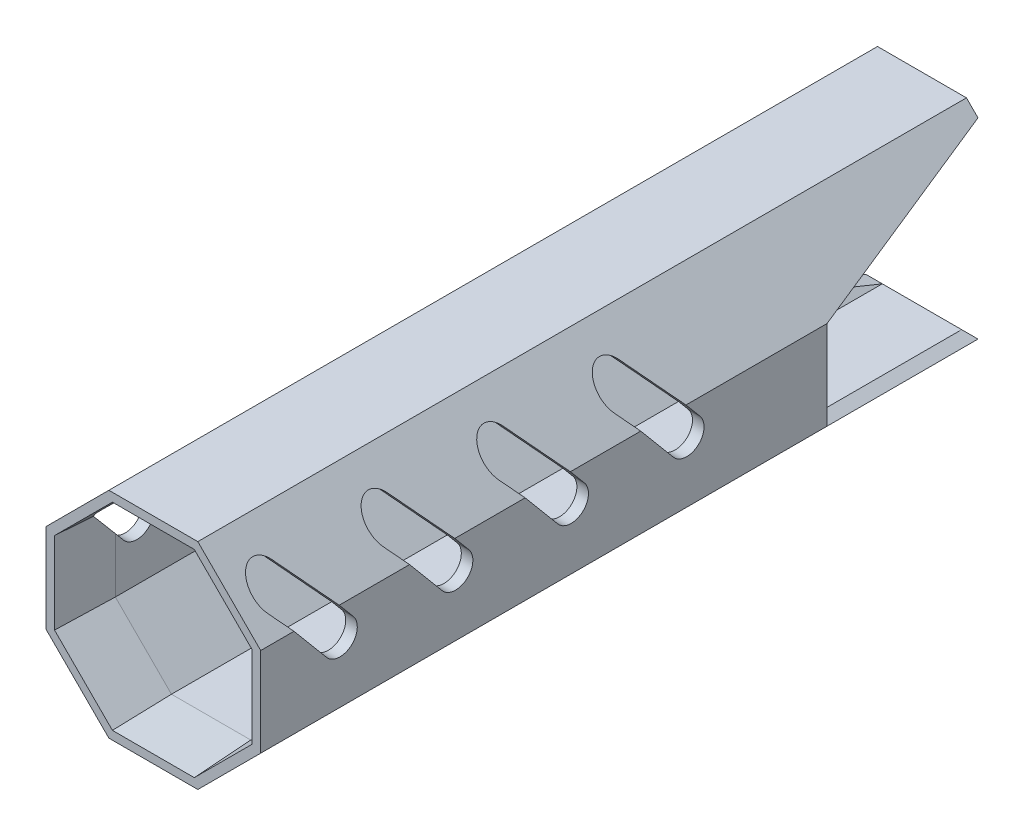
ISO-10303-21;
HEADER;
FILE_DESCRIPTION(('STEP AP214'),'2;1');
FILE_NAME('part.step','',(''),(''),'','','');
FILE_SCHEMA(('AUTOMOTIVE_DESIGN { 1 0 10303 214 1 1 1 1 }'));
ENDSEC;
DATA;
#1=APPLICATION_CONTEXT('core data for automotive mechanical design processes');
#2=APPLICATION_PROTOCOL_DEFINITION('international standard','automotive_design',2000,#1);
#3=PRODUCT_CONTEXT('',#1,'mechanical');
#4=PRODUCT('Part','Part','',(#3));
#5=PRODUCT_RELATED_PRODUCT_CATEGORY('part','',(#4));
#6=PRODUCT_DEFINITION_FORMATION('','',#4);
#7=PRODUCT_DEFINITION_CONTEXT('part definition',#1,'design');
#8=PRODUCT_DEFINITION('design','',#6,#7);
#9=PRODUCT_DEFINITION_SHAPE('','',#8);
#10=(LENGTH_UNIT() NAMED_UNIT(*) SI_UNIT(.MILLI.,.METRE.));
#11=(NAMED_UNIT(*) PLANE_ANGLE_UNIT() SI_UNIT($,.RADIAN.));
#12=(NAMED_UNIT(*) SI_UNIT($,.STERADIAN.) SOLID_ANGLE_UNIT());
#13=UNCERTAINTY_MEASURE_WITH_UNIT(LENGTH_MEASURE(1.E-05),#10,'distance_accuracy_value','');
#14=(GEOMETRIC_REPRESENTATION_CONTEXT(3) GLOBAL_UNCERTAINTY_ASSIGNED_CONTEXT((#13)) GLOBAL_UNIT_ASSIGNED_CONTEXT((#10,
#11,#12)) REPRESENTATION_CONTEXT('',''));
#15=CARTESIAN_POINT('',(0.,0.,0.));
#16=DIRECTION('',(0.,0.,1.));
#17=DIRECTION('',(1.,0.,0.));
#18=AXIS2_PLACEMENT_3D('',#15,#16,#17);
#19=CARTESIAN_POINT('',(16.575,6.86558979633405,247.));
#20=DIRECTION('',(-0.707106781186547,-0.707106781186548,0.));
#21=DIRECTION('',(0.707106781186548,-0.707106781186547,0.));
#22=AXIS2_PLACEMENT_3D('',#19,#20,#21);
#23=PLANE('',#22);
#24=DIRECTION('',(0.,0.,-1.));
#25=VECTOR('',#24,1.);
#26=CARTESIAN_POINT('',(6.86558979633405,16.575,247.));
#27=LINE('',#26,#25);
#28=CARTESIAN_POINT('',(6.86558979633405,16.575,112.999999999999));
#29=VERTEX_POINT('',#28);
#30=CARTESIAN_POINT('',(6.86558979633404,16.575,-10.));
#31=VERTEX_POINT('',#30);
#32=EDGE_CURVE('E696',#29,#31,#27,.T.);
#33=ORIENTED_EDGE('',*,*,#32,.T.);
#34=DIRECTION('',(0.23883072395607,-0.23883072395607,0.941233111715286));
#35=VECTOR('',#34,1.);
#36=CARTESIAN_POINT('',(65.7456556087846,-42.3050658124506,222.046642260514));
#37=LINE('',#36,#35);
#38=CARTESIAN_POINT('',(15.7465728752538,7.69401692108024,25.));
#39=VERTEX_POINT('',#38);
#40=EDGE_CURVE('E930',#31,#39,#37,.T.);
#41=ORIENTED_EDGE('',*,*,#40,.T.);
#42=DIRECTION('',(-0.707106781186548,0.707106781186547,0.));
#43=VECTOR('',#42,1.);
#44=CARTESIAN_POINT('',(16.5750000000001,6.86558979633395,25.));
#45=LINE('',#44,#43);
#46=CARTESIAN_POINT('',(16.575,6.86558979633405,25.));
#47=VERTEX_POINT('',#46);
#48=EDGE_CURVE('E929',#47,#39,#45,.T.);
#49=ORIENTED_EDGE('',*,*,#48,.F.);
#50=DIRECTION('',(0.,0.,-1.));
#51=VECTOR('',#50,1.);
#52=CARTESIAN_POINT('',(16.575,6.86558979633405,247.));
#53=LINE('',#52,#51);
#54=CARTESIAN_POINT('',(16.575,6.86558979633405,48.712563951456));
#55=VERTEX_POINT('',#54);
#56=EDGE_CURVE('E699',#55,#47,#53,.T.);
#57=ORIENTED_EDGE('',*,*,#56,.F.);
#58=DIRECTION('',(0.608120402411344,-0.608120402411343,-0.510273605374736));
#59=VECTOR('',#58,1.);
#60=CARTESIAN_POINT('',(-44.9551361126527,68.3957259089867,100.34247846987));
#61=LINE('',#60,#59);
#62=CARTESIAN_POINT('',(9.43722696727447,14.0033628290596,54.7018666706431));
#63=VERTEX_POINT('',#62);
#64=EDGE_CURVE('E577',#63,#55,#61,.T.);
#65=ORIENTED_EDGE('',*,*,#64,.F.);
#66=CARTESIAN_POINT('',(11.365589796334,12.075,57.));
#67=DIRECTION('',(-0.707106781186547,-0.707106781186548,0.));
#68=DIRECTION('',(0.707106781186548,-0.707106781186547,0.));
#69=AXIS2_PLACEMENT_3D('',#66,#67,#68);
#70=ELLIPSE('',#69,4.24264068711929,3.);
#71=CARTESIAN_POINT('',(13.2939526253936,10.1466371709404,59.2981333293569));
#72=VERTEX_POINT('',#71);
#73=EDGE_CURVE('E644',#72,#63,#70,.T.);
#74=ORIENTED_EDGE('',*,*,#73,.F.);
#75=DIRECTION('',(-0.608120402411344,0.608120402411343,0.510273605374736));
#76=VECTOR('',#75,1.);
#77=CARTESIAN_POINT('',(-42.5246678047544,65.9652576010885,106.135517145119));
#78=LINE('',#77,#76);
#79=CARTESIAN_POINT('',(16.575,6.86558979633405,56.5450076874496));
#80=VERTEX_POINT('',#79);
#81=EDGE_CURVE('E899',#80,#72,#78,.T.);
#82=ORIENTED_EDGE('',*,*,#81,.F.);
#83=CARTESIAN_POINT('',(16.575,6.86558979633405,68.7125639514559));
#84=VERTEX_POINT('',#83);
#85=EDGE_CURVE('E702',#84,#80,#53,.T.);
#86=ORIENTED_EDGE('',*,*,#85,.F.);
#87=DIRECTION('',(0.608120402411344,-0.608120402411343,-0.510273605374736));
#88=VECTOR('',#87,1.);
#89=CARTESIAN_POINT('',(-38.7489803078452,62.1895701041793,115.134895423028));
#90=LINE('',#89,#88);
#91=CARTESIAN_POINT('',(9.43722696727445,14.0033628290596,74.701866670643));
#92=VERTEX_POINT('',#91);
#93=EDGE_CURVE('E601',#92,#84,#90,.T.);
#94=ORIENTED_EDGE('',*,*,#93,.F.);
#95=CARTESIAN_POINT('',(11.365589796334,12.075,77.));
#96=DIRECTION('',(-0.707106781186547,-0.707106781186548,0.));
#97=DIRECTION('',(0.707106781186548,-0.707106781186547,0.));
#98=AXIS2_PLACEMENT_3D('',#95,#96,#97);
#99=ELLIPSE('',#98,4.24264068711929,3.);
#100=CARTESIAN_POINT('',(13.2939526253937,10.1466371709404,79.2981333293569));
#101=VERTEX_POINT('',#100);
#102=EDGE_CURVE('E651',#101,#92,#99,.T.);
#103=ORIENTED_EDGE('',*,*,#102,.F.);
#104=DIRECTION('',(-0.608120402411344,0.608120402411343,0.510273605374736));
#105=VECTOR('',#104,1.);
#106=CARTESIAN_POINT('',(-36.318511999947,59.7591017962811,120.927934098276));
#107=LINE('',#106,#105);
#108=CARTESIAN_POINT('',(16.575,6.86558979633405,76.5450076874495));
#109=VERTEX_POINT('',#108);
#110=EDGE_CURVE('E584',#109,#101,#107,.T.);
#111=ORIENTED_EDGE('',*,*,#110,.F.);
#112=CARTESIAN_POINT('',(16.575,6.86558979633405,88.7125639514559));
#113=VERTEX_POINT('',#112);
#114=EDGE_CURVE('E1846',#113,#109,#53,.T.);
#115=ORIENTED_EDGE('',*,*,#114,.F.);
#116=DIRECTION('',(0.608120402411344,-0.608120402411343,-0.510273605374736));
#117=VECTOR('',#116,1.);
#118=CARTESIAN_POINT('',(-32.5428245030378,55.9834142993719,129.927312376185));
#119=LINE('',#118,#117);
#120=CARTESIAN_POINT('',(9.43722696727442,14.0033628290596,94.7018666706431));
#121=VERTEX_POINT('',#120);
#122=EDGE_CURVE('E631',#121,#113,#119,.T.);
#123=ORIENTED_EDGE('',*,*,#122,.F.);
#124=CARTESIAN_POINT('',(11.365589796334,12.075,97.));
#125=DIRECTION('',(-0.707106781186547,-0.707106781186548,0.));
#126=DIRECTION('',(0.707106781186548,-0.707106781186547,0.));
#127=AXIS2_PLACEMENT_3D('',#124,#125,#126);
#128=ELLIPSE('',#127,4.24264068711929,3.);
#129=CARTESIAN_POINT('',(13.2939526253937,10.1466371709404,99.2981333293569));
#130=VERTEX_POINT('',#129);
#131=EDGE_CURVE('E658',#130,#121,#128,.T.);
#132=ORIENTED_EDGE('',*,*,#131,.F.);
#133=DIRECTION('',(-0.608120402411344,0.608120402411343,0.510273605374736));
#134=VECTOR('',#133,1.);
#135=CARTESIAN_POINT('',(-30.1123561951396,53.5529459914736,135.720351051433));
#136=LINE('',#135,#134);
#137=CARTESIAN_POINT('',(16.575,6.86558979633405,96.5450076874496));
#138=VERTEX_POINT('',#137);
#139=EDGE_CURVE('E615',#138,#130,#136,.T.);
#140=ORIENTED_EDGE('',*,*,#139,.F.);
#141=CARTESIAN_POINT('',(16.575,6.86558979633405,108.712563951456));
#142=VERTEX_POINT('',#141);
#143=EDGE_CURVE('E703',#142,#138,#53,.T.);
#144=ORIENTED_EDGE('',*,*,#143,.F.);
#145=DIRECTION('',(0.608120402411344,-0.608120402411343,-0.510273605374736));
#146=VECTOR('',#145,1.);
#147=CARTESIAN_POINT('',(-26.3366686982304,49.7772584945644,144.719729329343));
#148=LINE('',#147,#146);
#149=CARTESIAN_POINT('',(11.4654326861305,11.9751571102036,112.999999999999));
#150=VERTEX_POINT('',#149);
#151=EDGE_CURVE('E871',#150,#142,#148,.T.);
#152=ORIENTED_EDGE('',*,*,#151,.F.);
#153=DIRECTION('',(-0.707106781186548,0.707106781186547,0.));
#154=VECTOR('',#153,1.);
#155=CARTESIAN_POINT('',(16.575,6.86558979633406,112.999999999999));
#156=LINE('',#155,#154);
#157=EDGE_CURVE('E994',#150,#29,#156,.T.);
#158=ORIENTED_EDGE('',*,*,#157,.T.);
#159=EDGE_LOOP('',(#33,#41,#49,#57,#65,#74,#82,#86,#94,#103,#111,#115,#123,#132,#140,#144,#152,#158));
#160=FACE_BOUND('',#159,.T.);
#161=ADVANCED_FACE('F35',(#160),#23,.T.);
#162=CARTESIAN_POINT('',(-6.86558979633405,16.575,247.));
#163=DIRECTION('',(0.707106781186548,-0.707106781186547,0.));
#164=DIRECTION('',(0.707106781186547,0.707106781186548,0.));
#165=AXIS2_PLACEMENT_3D('',#162,#163,#164);
#166=PLANE('',#165);
#167=DIRECTION('',(-0.707106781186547,-0.707106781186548,0.));
#168=VECTOR('',#167,1.);
#169=CARTESIAN_POINT('',(-6.86558979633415,16.5749999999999,25.));
#170=LINE('',#169,#168);
#171=CARTESIAN_POINT('',(-15.7465728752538,7.69401692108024,25.));
#172=VERTEX_POINT('',#171);
#173=CARTESIAN_POINT('',(-16.575,6.86558979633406,25.));
#174=VERTEX_POINT('',#173);
#175=EDGE_CURVE('E944',#172,#174,#170,.T.);
#176=ORIENTED_EDGE('',*,*,#175,.F.);
#177=DIRECTION('',(0.23883072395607,0.23883072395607,-0.941233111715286));
#178=VECTOR('',#177,1.);
#179=CARTESIAN_POINT('',(-64.6380038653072,-41.1974140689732,217.681381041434));
#180=LINE('',#179,#178);
#181=CARTESIAN_POINT('',(-6.86558979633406,16.575,-10.));
#182=VERTEX_POINT('',#181);
#183=EDGE_CURVE('E498',#172,#182,#180,.T.);
#184=ORIENTED_EDGE('',*,*,#183,.T.);
#185=DIRECTION('',(0.,0.,-1.));
#186=VECTOR('',#185,1.);
#187=CARTESIAN_POINT('',(-6.86558979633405,16.575,247.));
#188=LINE('',#187,#186);
#189=CARTESIAN_POINT('',(-6.86558979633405,16.575,112.999999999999));
#190=VERTEX_POINT('',#189);
#191=EDGE_CURVE('E693',#190,#182,#188,.T.);
#192=ORIENTED_EDGE('',*,*,#191,.F.);
#193=DIRECTION('',(-0.707106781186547,-0.707106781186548,0.));
#194=VECTOR('',#193,1.);
#195=CARTESIAN_POINT('',(-6.86558979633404,16.575,112.999999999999));
#196=LINE('',#195,#194);
#197=CARTESIAN_POINT('',(-11.4654326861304,11.9751571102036,112.999999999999));
#198=VERTEX_POINT('',#197);
#199=EDGE_CURVE('E1003',#190,#198,#196,.T.);
#200=ORIENTED_EDGE('',*,*,#199,.T.);
#201=DIRECTION('',(0.608120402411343,0.608120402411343,0.510273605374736));
#202=VECTOR('',#201,1.);
#203=CARTESIAN_POINT('',(33.5179509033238,56.9585406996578,150.745540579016));
#204=LINE('',#203,#202);
#205=CARTESIAN_POINT('',(-16.575,6.86558979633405,108.712563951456));
#206=VERTEX_POINT('',#205);
#207=EDGE_CURVE('E865',#206,#198,#204,.T.);
#208=ORIENTED_EDGE('',*,*,#207,.F.);
#209=DIRECTION('',(0.,0.,-1.));
#210=VECTOR('',#209,1.);
#211=CARTESIAN_POINT('',(-16.575,6.86558979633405,247.));
#212=LINE('',#211,#210);
#213=CARTESIAN_POINT('',(-16.575,6.86558979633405,96.5450076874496));
#214=VERTEX_POINT('',#213);
#215=EDGE_CURVE('E692',#206,#214,#212,.T.);
#216=ORIENTED_EDGE('',*,*,#215,.T.);
#217=DIRECTION('',(-0.608120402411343,-0.608120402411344,-0.510273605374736));
#218=VECTOR('',#217,1.);
#219=CARTESIAN_POINT('',(37.2936384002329,60.734228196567,141.746162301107));
#220=LINE('',#219,#218);
#221=CARTESIAN_POINT('',(-13.2939526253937,10.1466371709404,99.2981333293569));
#222=VERTEX_POINT('',#221);
#223=EDGE_CURVE('E613',#222,#214,#220,.T.);
#224=ORIENTED_EDGE('',*,*,#223,.F.);
#225=CARTESIAN_POINT('',(-11.365589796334,12.075,97.));
#226=DIRECTION('',(0.707106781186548,-0.707106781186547,0.));
#227=DIRECTION('',(0.707106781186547,0.707106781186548,0.));
#228=AXIS2_PLACEMENT_3D('',#225,#226,#227);
#229=ELLIPSE('',#228,4.24264068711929,3.);
#230=CARTESIAN_POINT('',(-9.43722696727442,14.0033628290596,94.7018666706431));
#231=VERTEX_POINT('',#230);
#232=EDGE_CURVE('E656',#231,#222,#229,.T.);
#233=ORIENTED_EDGE('',*,*,#232,.F.);
#234=DIRECTION('',(0.608120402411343,0.608120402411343,0.510273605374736));
#235=VECTOR('',#234,1.);
#236=CARTESIAN_POINT('',(39.7241067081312,63.1646965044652,135.953123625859));
#237=LINE('',#236,#235);
#238=CARTESIAN_POINT('',(-16.575,6.86558979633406,88.7125639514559));
#239=VERTEX_POINT('',#238);
#240=EDGE_CURVE('E629',#239,#231,#237,.T.);
#241=ORIENTED_EDGE('',*,*,#240,.F.);
#242=CARTESIAN_POINT('',(-16.575,6.86558979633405,76.5450076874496));
#243=VERTEX_POINT('',#242);
#244=EDGE_CURVE('E1076',#239,#243,#212,.T.);
#245=ORIENTED_EDGE('',*,*,#244,.T.);
#246=DIRECTION('',(-0.608120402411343,-0.608120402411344,-0.510273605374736));
#247=VECTOR('',#246,1.);
#248=CARTESIAN_POINT('',(43.4997942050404,66.9403840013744,126.95374534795));
#249=LINE('',#248,#247);
#250=CARTESIAN_POINT('',(-13.2939526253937,10.1466371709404,79.2981333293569));
#251=VERTEX_POINT('',#250);
#252=EDGE_CURVE('E582',#251,#243,#249,.T.);
#253=ORIENTED_EDGE('',*,*,#252,.F.);
#254=CARTESIAN_POINT('',(-11.365589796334,12.075,77.));
#255=DIRECTION('',(0.707106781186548,-0.707106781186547,0.));
#256=DIRECTION('',(0.707106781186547,0.707106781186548,0.));
#257=AXIS2_PLACEMENT_3D('',#254,#255,#256);
#258=ELLIPSE('',#257,4.24264068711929,3.);
#259=CARTESIAN_POINT('',(-9.43722696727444,14.0033628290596,74.701866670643));
#260=VERTEX_POINT('',#259);
#261=EDGE_CURVE('E649',#260,#251,#258,.T.);
#262=ORIENTED_EDGE('',*,*,#261,.F.);
#263=DIRECTION('',(0.608120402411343,0.608120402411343,0.510273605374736));
#264=VECTOR('',#263,1.);
#265=CARTESIAN_POINT('',(45.9302625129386,69.3708523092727,121.160706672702));
#266=LINE('',#265,#264);
#267=CARTESIAN_POINT('',(-16.575,6.86558979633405,68.7125639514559));
#268=VERTEX_POINT('',#267);
#269=EDGE_CURVE('E599',#268,#260,#266,.T.);
#270=ORIENTED_EDGE('',*,*,#269,.F.);
#271=CARTESIAN_POINT('',(-16.575,6.86558979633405,56.5450076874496));
#272=VERTEX_POINT('',#271);
#273=EDGE_CURVE('E691',#268,#272,#212,.T.);
#274=ORIENTED_EDGE('',*,*,#273,.T.);
#275=DIRECTION('',(-0.608120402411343,-0.608120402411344,-0.510273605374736));
#276=VECTOR('',#275,1.);
#277=CARTESIAN_POINT('',(49.7059500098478,73.1465398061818,112.161328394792));
#278=LINE('',#277,#276);
#279=CARTESIAN_POINT('',(-13.2939526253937,10.1466371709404,59.2981333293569));
#280=VERTEX_POINT('',#279);
#281=EDGE_CURVE('E897',#280,#272,#278,.T.);
#282=ORIENTED_EDGE('',*,*,#281,.F.);
#283=CARTESIAN_POINT('',(-11.365589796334,12.075,57.));
#284=DIRECTION('',(0.707106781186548,-0.707106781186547,0.));
#285=DIRECTION('',(0.707106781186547,0.707106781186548,0.));
#286=AXIS2_PLACEMENT_3D('',#283,#284,#285);
#287=ELLIPSE('',#286,4.24264068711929,3.);
#288=CARTESIAN_POINT('',(-9.43722696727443,14.0033628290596,54.7018666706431));
#289=VERTEX_POINT('',#288);
#290=EDGE_CURVE('E642',#289,#280,#287,.T.);
#291=ORIENTED_EDGE('',*,*,#290,.F.);
#292=DIRECTION('',(0.608120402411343,0.608120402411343,0.510273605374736));
#293=VECTOR('',#292,1.);
#294=CARTESIAN_POINT('',(52.136418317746,75.5770081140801,106.368289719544));
#295=LINE('',#294,#293);
#296=CARTESIAN_POINT('',(-16.575,6.86558979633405,48.712563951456));
#297=VERTEX_POINT('',#296);
#298=EDGE_CURVE('E913',#297,#289,#295,.T.);
#299=ORIENTED_EDGE('',*,*,#298,.F.);
#300=EDGE_CURVE('E688',#297,#174,#212,.T.);
#301=ORIENTED_EDGE('',*,*,#300,.T.);
#302=EDGE_LOOP('',(#176,#184,#192,#200,#208,#216,#224,#233,#241,#245,#253,#262,#270,#274,#282,
#291,#299,#301));
#303=FACE_BOUND('',#302,.T.);
#304=ADVANCED_FACE('F1047',(#303),#166,.T.);
#305=CARTESIAN_POINT('',(-16.575,-6.86558979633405,247.));
#306=DIRECTION('',(0.707106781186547,0.707106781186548,0.));
#307=DIRECTION('',(-0.707106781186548,0.707106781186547,0.));
#308=AXIS2_PLACEMENT_3D('',#305,#306,#307);
#309=PLANE('',#308);
#310=DIRECTION('',(0.,0.,-1.));
#311=VECTOR('',#310,1.);
#312=CARTESIAN_POINT('',(-6.86558979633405,-16.575,247.));
#313=LINE('',#312,#311);
#314=CARTESIAN_POINT('',(-6.86558979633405,-16.575,112.999999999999));
#315=VERTEX_POINT('',#314);
#316=CARTESIAN_POINT('',(-6.86558979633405,-16.575,-10.));
#317=VERTEX_POINT('',#316);
#318=EDGE_CURVE('E682',#315,#317,#313,.T.);
#319=ORIENTED_EDGE('',*,*,#318,.T.);
#320=DIRECTION('',(-0.23883072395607,0.23883072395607,0.941233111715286));
#321=VECTOR('',#320,1.);
#322=CARTESIAN_POINT('',(-65.7456556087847,42.3050658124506,222.046642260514));
#323=LINE('',#322,#321);
#324=CARTESIAN_POINT('',(-15.7465728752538,-7.69401692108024,25.));
#325=VERTEX_POINT('',#324);
#326=EDGE_CURVE('E524',#317,#325,#323,.T.);
#327=ORIENTED_EDGE('',*,*,#326,.T.);
#328=DIRECTION('',(0.707106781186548,-0.707106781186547,0.));
#329=VECTOR('',#328,1.);
#330=CARTESIAN_POINT('',(-16.5749999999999,-6.86558979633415,25.));
#331=LINE('',#330,#329);
#332=CARTESIAN_POINT('',(-16.575,-6.86558979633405,25.));
#333=VERTEX_POINT('',#332);
#334=EDGE_CURVE('E934',#333,#325,#331,.T.);
#335=ORIENTED_EDGE('',*,*,#334,.F.);
#336=DIRECTION('',(0.,0.,-1.));
#337=VECTOR('',#336,1.);
#338=CARTESIAN_POINT('',(-16.575,-6.86558979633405,247.));
#339=LINE('',#338,#337);
#340=CARTESIAN_POINT('',(-16.575,-6.86558979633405,112.999999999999));
#341=VERTEX_POINT('',#340);
#342=EDGE_CURVE('E685',#341,#333,#339,.T.);
#343=ORIENTED_EDGE('',*,*,#342,.F.);
#344=DIRECTION('',(0.707106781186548,-0.707106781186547,0.));
#345=VECTOR('',#344,1.);
#346=CARTESIAN_POINT('',(-16.575,-6.86558979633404,112.999999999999));
#347=LINE('',#346,#345);
#348=EDGE_CURVE('E1140',#341,#315,#347,.T.);
#349=ORIENTED_EDGE('',*,*,#348,.T.);
#350=EDGE_LOOP('',(#319,#327,#335,#343,#349));
#351=FACE_BOUND('',#350,.T.);
#352=ADVANCED_FACE('F1112',(#351),#309,.T.);
#353=CARTESIAN_POINT('',(6.86558979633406,-16.575,247.));
#354=DIRECTION('',(-0.707106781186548,0.707106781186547,0.));
#355=DIRECTION('',(-0.707106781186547,-0.707106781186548,0.));
#356=AXIS2_PLACEMENT_3D('',#353,#354,#355);
#357=PLANE('',#356);
#358=DIRECTION('',(0.707106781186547,0.707106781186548,0.));
#359=VECTOR('',#358,1.);
#360=CARTESIAN_POINT('',(6.86558979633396,-16.5750000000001,25.));
#361=LINE('',#360,#359);
#362=CARTESIAN_POINT('',(15.7465728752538,-7.69401692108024,25.));
#363=VERTEX_POINT('',#362);
#364=CARTESIAN_POINT('',(16.575,-6.86558979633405,25.));
#365=VERTEX_POINT('',#364);
#366=EDGE_CURVE('E939',#363,#365,#361,.T.);
#367=ORIENTED_EDGE('',*,*,#366,.F.);
#368=DIRECTION('',(-0.23883072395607,-0.23883072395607,-0.941233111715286));
#369=VECTOR('',#368,1.);
#370=CARTESIAN_POINT('',(64.6380038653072,41.1974140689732,217.681381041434));
#371=LINE('',#370,#369);
#372=CARTESIAN_POINT('',(6.86558979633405,-16.575,-10.));
#373=VERTEX_POINT('',#372);
#374=EDGE_CURVE('E1117',#363,#373,#371,.T.);
#375=ORIENTED_EDGE('',*,*,#374,.T.);
#376=DIRECTION('',(0.,0.,-1.));
#377=VECTOR('',#376,1.);
#378=CARTESIAN_POINT('',(6.86558979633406,-16.575,247.));
#379=LINE('',#378,#377);
#380=CARTESIAN_POINT('',(6.86558979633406,-16.575,112.999999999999));
#381=VERTEX_POINT('',#380);
#382=EDGE_CURVE('E679',#381,#373,#379,.T.);
#383=ORIENTED_EDGE('',*,*,#382,.F.);
#384=DIRECTION('',(0.707106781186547,0.707106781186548,0.));
#385=VECTOR('',#384,1.);
#386=CARTESIAN_POINT('',(6.86558979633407,-16.575,112.999999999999));
#387=LINE('',#386,#385);
#388=CARTESIAN_POINT('',(16.575,-6.86558979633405,112.999999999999));
#389=VERTEX_POINT('',#388);
#390=EDGE_CURVE('E986',#381,#389,#387,.T.);
#391=ORIENTED_EDGE('',*,*,#390,.T.);
#392=DIRECTION('',(0.,0.,-1.));
#393=VECTOR('',#392,1.);
#394=CARTESIAN_POINT('',(16.575,-6.86558979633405,247.));
#395=LINE('',#394,#393);
#396=EDGE_CURVE('E676',#389,#365,#395,.T.);
#397=ORIENTED_EDGE('',*,*,#396,.T.);
#398=EDGE_LOOP('',(#367,#375,#383,#391,#397));
#399=FACE_BOUND('',#398,.T.);
#400=ADVANCED_FACE('F983',(#399),#357,.T.);
#401=CARTESIAN_POINT('',(18.575,7.69401692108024,247.));
#402=DIRECTION('',(-0.707106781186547,-0.707106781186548,0.));
#403=DIRECTION('',(0.707106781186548,-0.707106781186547,0.));
#404=AXIS2_PLACEMENT_3D('',#401,#402,#403);
#405=PLANE('',#404);
#406=DIRECTION('',(0.23883072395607,-0.23883072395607,0.941233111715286));
#407=VECTOR('',#406,1.);
#408=CARTESIAN_POINT('',(68.4795755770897,-42.2105586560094,221.674189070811));
#409=LINE('',#408,#407);
#410=CARTESIAN_POINT('',(9.69401692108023,16.575,-10.));
#411=VERTEX_POINT('',#410);
#412=CARTESIAN_POINT('',(18.575,7.69401692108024,25.));
#413=VERTEX_POINT('',#412);
#414=EDGE_CURVE('E523',#411,#413,#409,.T.);
#415=ORIENTED_EDGE('',*,*,#414,.F.);
#416=DIRECTION('',(0.707106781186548,-0.707106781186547,0.));
#417=VECTOR('',#416,1.);
#418=CARTESIAN_POINT('',(7.69401692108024,18.575,-10.));
#419=LINE('',#418,#417);
#420=CARTESIAN_POINT('',(7.69401692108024,18.575,-10.));
#421=VERTEX_POINT('',#420);
#422=EDGE_CURVE('E952',#421,#411,#419,.T.);
#423=ORIENTED_EDGE('',*,*,#422,.F.);
#424=DIRECTION('',(0.,0.,-1.));
#425=VECTOR('',#424,1.);
#426=CARTESIAN_POINT('',(7.69401692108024,18.575,247.));
#427=LINE('',#426,#425);
#428=CARTESIAN_POINT('',(7.69401692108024,18.575,123.));
#429=VERTEX_POINT('',#428);
#430=EDGE_CURVE('E546',#429,#421,#427,.T.);
#431=ORIENTED_EDGE('',*,*,#430,.F.);
#432=DIRECTION('',(-0.707106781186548,0.707106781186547,0.));
#433=VECTOR('',#432,1.);
#434=CARTESIAN_POINT('',(18.575,7.69401692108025,123.));
#435=LINE('',#434,#433);
#436=CARTESIAN_POINT('',(18.575,7.69401692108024,123.));
#437=VERTEX_POINT('',#436);
#438=EDGE_CURVE('E670',#437,#429,#435,.T.);
#439=ORIENTED_EDGE('',*,*,#438,.F.);
#440=DIRECTION('',(0.,0.,-1.));
#441=VECTOR('',#440,1.);
#442=CARTESIAN_POINT('',(18.575,7.69401692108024,247.));
#443=LINE('',#442,#441);
#444=CARTESIAN_POINT('',(18.575,7.69401692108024,117.240140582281));
#445=VERTEX_POINT('',#444);
#446=EDGE_CURVE('E1133',#437,#445,#443,.T.);
#447=ORIENTED_EDGE('',*,*,#446,.T.);
#448=DIRECTION('',(-0.608120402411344,0.608120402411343,0.510273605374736));
#449=VECTOR('',#448,1.);
#450=CARTESIAN_POINT('',(-21.6904952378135,47.9595121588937,151.026902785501));
#451=LINE('',#450,#449);
#452=CARTESIAN_POINT('',(16.1223797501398,10.1466371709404,119.298133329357));
#453=VERTEX_POINT('',#452);
#454=EDGE_CURVE('E862',#445,#453,#451,.T.);
#455=ORIENTED_EDGE('',*,*,#454,.T.);
#456=CARTESIAN_POINT('',(14.1940169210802,12.075,117.));
#457=DIRECTION('',(-0.707106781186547,-0.707106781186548,0.));
#458=DIRECTION('',(0.707106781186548,-0.707106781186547,0.));
#459=AXIS2_PLACEMENT_3D('',#456,#457,#458);
#460=ELLIPSE('',#459,4.24264068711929,3.);
#461=CARTESIAN_POINT('',(12.2656540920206,14.0033628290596,114.701866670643));
#462=VERTEX_POINT('',#461);
#463=EDGE_CURVE('E886',#453,#462,#460,.T.);
#464=ORIENTED_EDGE('',*,*,#463,.T.);
#465=DIRECTION('',(0.608120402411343,-0.608120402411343,-0.510273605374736));
#466=VECTOR('',#465,1.);
#467=CARTESIAN_POINT('',(-24.1209635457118,50.389980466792,145.233864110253));
#468=LINE('',#467,#466);
#469=CARTESIAN_POINT('',(18.575,7.69401692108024,109.407696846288));
#470=VERTEX_POINT('',#469);
#471=EDGE_CURVE('E878',#462,#470,#468,.T.);
#472=ORIENTED_EDGE('',*,*,#471,.T.);
#473=CARTESIAN_POINT('',(18.575,7.69401692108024,97.2401405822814));
#474=VERTEX_POINT('',#473);
#475=EDGE_CURVE('E1138',#470,#474,#443,.T.);
#476=ORIENTED_EDGE('',*,*,#475,.T.);
#477=DIRECTION('',(-0.608120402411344,0.608120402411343,0.510273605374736));
#478=VECTOR('',#477,1.);
#479=CARTESIAN_POINT('',(-27.8966510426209,54.1656679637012,136.234485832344));
#480=LINE('',#479,#478);
#481=CARTESIAN_POINT('',(16.1223797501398,10.1466371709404,99.2981333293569));
#482=VERTEX_POINT('',#481);
#483=EDGE_CURVE('E608',#474,#482,#480,.T.);
#484=ORIENTED_EDGE('',*,*,#483,.T.);
#485=CARTESIAN_POINT('',(14.1940169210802,12.075,97.));
#486=DIRECTION('',(-0.707106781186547,-0.707106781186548,0.));
#487=DIRECTION('',(0.707106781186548,-0.707106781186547,0.));
#488=AXIS2_PLACEMENT_3D('',#485,#486,#487);
#489=ELLIPSE('',#488,4.24264068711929,3.);
#490=CARTESIAN_POINT('',(12.2656540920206,14.0033628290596,94.7018666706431));
#491=VERTEX_POINT('',#490);
#492=EDGE_CURVE('E653',#482,#491,#489,.T.);
#493=ORIENTED_EDGE('',*,*,#492,.T.);
#494=DIRECTION('',(0.608120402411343,-0.608120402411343,-0.510273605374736));
#495=VECTOR('',#494,1.);
#496=CARTESIAN_POINT('',(-30.3271193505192,56.5961362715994,130.441447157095));
#497=LINE('',#496,#495);
#498=CARTESIAN_POINT('',(18.575,7.69401692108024,89.4076968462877));
#499=VERTEX_POINT('',#498);
#500=EDGE_CURVE('E624',#491,#499,#497,.T.);
#501=ORIENTED_EDGE('',*,*,#500,.T.);
#502=CARTESIAN_POINT('',(18.575,7.69401692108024,77.2401405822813));
#503=VERTEX_POINT('',#502);
#504=EDGE_CURVE('E1143',#499,#503,#443,.T.);
#505=ORIENTED_EDGE('',*,*,#504,.T.);
#506=DIRECTION('',(-0.608120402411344,0.608120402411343,0.510273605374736));
#507=VECTOR('',#506,1.);
#508=CARTESIAN_POINT('',(-34.1028068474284,60.3718237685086,121.442068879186));
#509=LINE('',#508,#507);
#510=CARTESIAN_POINT('',(16.1223797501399,10.1466371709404,79.2981333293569));
#511=VERTEX_POINT('',#510);
#512=EDGE_CURVE('E571',#503,#511,#509,.T.);
#513=ORIENTED_EDGE('',*,*,#512,.T.);
#514=CARTESIAN_POINT('',(14.1940169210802,12.075,77.));
#515=DIRECTION('',(-0.707106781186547,-0.707106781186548,0.));
#516=DIRECTION('',(0.707106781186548,-0.707106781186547,0.));
#517=AXIS2_PLACEMENT_3D('',#514,#515,#516);
#518=ELLIPSE('',#517,4.24264068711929,3.);
#519=CARTESIAN_POINT('',(12.2656540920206,14.0033628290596,74.701866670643));
#520=VERTEX_POINT('',#519);
#521=EDGE_CURVE('E646',#511,#520,#518,.T.);
#522=ORIENTED_EDGE('',*,*,#521,.T.);
#523=DIRECTION('',(0.608120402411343,-0.608120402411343,-0.510273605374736));
#524=VECTOR('',#523,1.);
#525=CARTESIAN_POINT('',(-36.5332751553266,62.8022920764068,115.649030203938));
#526=LINE('',#525,#524);
#527=CARTESIAN_POINT('',(18.575,7.69401692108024,69.4076968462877));
#528=VERTEX_POINT('',#527);
#529=EDGE_CURVE('E594',#520,#528,#526,.T.);
#530=ORIENTED_EDGE('',*,*,#529,.T.);
#531=CARTESIAN_POINT('',(18.575,7.69401692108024,57.2401405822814));
#532=VERTEX_POINT('',#531);
#533=EDGE_CURVE('E1145',#528,#532,#443,.T.);
#534=ORIENTED_EDGE('',*,*,#533,.T.);
#535=DIRECTION('',(-0.608120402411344,0.608120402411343,0.510273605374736));
#536=VECTOR('',#535,1.);
#537=CARTESIAN_POINT('',(-40.3089626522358,66.577979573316,106.649651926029));
#538=LINE('',#537,#536);
#539=CARTESIAN_POINT('',(16.1223797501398,10.1466371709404,59.2981333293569));
#540=VERTEX_POINT('',#539);
#541=EDGE_CURVE('E892',#532,#540,#538,.T.);
#542=ORIENTED_EDGE('',*,*,#541,.T.);
#543=CARTESIAN_POINT('',(14.1940169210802,12.075,57.));
#544=DIRECTION('',(-0.707106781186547,-0.707106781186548,0.));
#545=DIRECTION('',(0.707106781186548,-0.707106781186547,0.));
#546=AXIS2_PLACEMENT_3D('',#543,#544,#545);
#547=ELLIPSE('',#546,4.24264068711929,3.);
#548=CARTESIAN_POINT('',(12.2656540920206,14.0033628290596,54.7018666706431));
#549=VERTEX_POINT('',#548);
#550=EDGE_CURVE('E639',#540,#549,#547,.T.);
#551=ORIENTED_EDGE('',*,*,#550,.T.);
#552=DIRECTION('',(0.608120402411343,-0.608120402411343,-0.510273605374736));
#553=VECTOR('',#552,1.);
#554=CARTESIAN_POINT('',(-42.739430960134,69.0084478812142,100.856613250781));
#555=LINE('',#554,#553);
#556=CARTESIAN_POINT('',(18.575,7.69401692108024,49.4076968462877));
#557=VERTEX_POINT('',#556);
#558=EDGE_CURVE('E908',#549,#557,#555,.T.);
#559=ORIENTED_EDGE('',*,*,#558,.T.);
#560=EDGE_CURVE('E966',#557,#413,#443,.T.);
#561=ORIENTED_EDGE('',*,*,#560,.T.);
#562=EDGE_LOOP('',(#415,#423,#431,#439,#447,#455,#464,#472,#476,#484,#493,#501,#505,#513,#522,
#530,#534,#542,#551,#559,#561));
#563=FACE_BOUND('',#562,.T.);
#564=ADVANCED_FACE('F962',(#563),#405,.F.);
#565=CARTESIAN_POINT('',(-7.69401692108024,18.575,247.));
#566=DIRECTION('',(0.707106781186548,-0.707106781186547,0.));
#567=DIRECTION('',(0.707106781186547,0.707106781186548,0.));
#568=AXIS2_PLACEMENT_3D('',#565,#566,#567);
#569=PLANE('',#568);
#570=DIRECTION('',(0.23883072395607,0.23883072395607,-0.941233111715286));
#571=VECTOR('',#570,1.);
#572=CARTESIAN_POINT('',(-67.2382705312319,-40.9692536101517,216.782199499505));
#573=LINE('',#572,#571);
#574=CARTESIAN_POINT('',(-18.575,7.69401692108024,25.));
#575=VERTEX_POINT('',#574);
#576=CARTESIAN_POINT('',(-9.69401692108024,16.575,-10.));
#577=VERTEX_POINT('',#576);
#578=EDGE_CURVE('E495',#575,#577,#573,.T.);
#579=ORIENTED_EDGE('',*,*,#578,.F.);
#580=DIRECTION('',(0.,0.,-1.));
#581=VECTOR('',#580,1.);
#582=CARTESIAN_POINT('',(-18.575,7.69401692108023,247.));
#583=LINE('',#582,#581);
#584=CARTESIAN_POINT('',(-18.575,7.69401692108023,49.4076968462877));
#585=VERTEX_POINT('',#584);
#586=EDGE_CURVE('E520',#585,#575,#583,.T.);
#587=ORIENTED_EDGE('',*,*,#586,.F.);
#588=DIRECTION('',(0.608120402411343,0.608120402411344,0.510273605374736));
#589=VECTOR('',#588,1.);
#590=CARTESIAN_POINT('',(50.7872328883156,77.0562498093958,107.609520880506));
#591=LINE('',#590,#589);
#592=CARTESIAN_POINT('',(-12.2656540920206,14.0033628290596,54.7018666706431));
#593=VERTEX_POINT('',#592);
#594=EDGE_CURVE('E906',#585,#593,#591,.T.);
#595=ORIENTED_EDGE('',*,*,#594,.T.);
#596=CARTESIAN_POINT('',(-14.1940169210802,12.075,57.));
#597=DIRECTION('',(0.707106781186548,-0.707106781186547,0.));
#598=DIRECTION('',(0.707106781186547,0.707106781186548,0.));
#599=AXIS2_PLACEMENT_3D('',#596,#597,#598);
#600=ELLIPSE('',#599,4.24264068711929,3.);
#601=CARTESIAN_POINT('',(-16.1223797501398,10.1466371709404,59.2981333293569));
#602=VERTEX_POINT('',#601);
#603=EDGE_CURVE('E1037',#593,#602,#600,.T.);
#604=ORIENTED_EDGE('',*,*,#603,.T.);
#605=DIRECTION('',(-0.608120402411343,-0.608120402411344,-0.510273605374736));
#606=VECTOR('',#605,1.);
#607=CARTESIAN_POINT('',(48.3567645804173,74.6257815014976,113.402559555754));
#608=LINE('',#607,#606);
#609=CARTESIAN_POINT('',(-18.575,7.69401692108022,57.2401405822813));
#610=VERTEX_POINT('',#609);
#611=EDGE_CURVE('E889',#602,#610,#608,.T.);
#612=ORIENTED_EDGE('',*,*,#611,.T.);
#613=CARTESIAN_POINT('',(-18.575,7.69401692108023,69.4076968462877));
#614=VERTEX_POINT('',#613);
#615=EDGE_CURVE('E531',#614,#610,#583,.T.);
#616=ORIENTED_EDGE('',*,*,#615,.F.);
#617=DIRECTION('',(0.608120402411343,0.608120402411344,0.510273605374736));
#618=VECTOR('',#617,1.);
#619=CARTESIAN_POINT('',(44.5810770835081,70.8500940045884,122.401937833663));
#620=LINE('',#619,#618);
#621=CARTESIAN_POINT('',(-12.2656540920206,14.0033628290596,74.701866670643));
#622=VERTEX_POINT('',#621);
#623=EDGE_CURVE('E592',#614,#622,#620,.T.);
#624=ORIENTED_EDGE('',*,*,#623,.T.);
#625=CARTESIAN_POINT('',(-14.1940169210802,12.075,77.));
#626=DIRECTION('',(0.707106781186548,-0.707106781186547,0.));
#627=DIRECTION('',(0.707106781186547,0.707106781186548,0.));
#628=AXIS2_PLACEMENT_3D('',#625,#626,#627);
#629=ELLIPSE('',#628,4.24264068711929,3.);
#630=CARTESIAN_POINT('',(-16.1223797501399,10.1466371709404,79.2981333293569));
#631=VERTEX_POINT('',#630);
#632=EDGE_CURVE('E567',#622,#631,#629,.T.);
#633=ORIENTED_EDGE('',*,*,#632,.T.);
#634=DIRECTION('',(-0.608120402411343,-0.608120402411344,-0.510273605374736));
#635=VECTOR('',#634,1.);
#636=CARTESIAN_POINT('',(42.1506087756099,68.4196256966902,128.194976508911));
#637=LINE('',#636,#635);
#638=CARTESIAN_POINT('',(-18.575,7.69401692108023,77.2401405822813));
#639=VERTEX_POINT('',#638);
#640=EDGE_CURVE('E565',#631,#639,#637,.T.);
#641=ORIENTED_EDGE('',*,*,#640,.T.);
#642=CARTESIAN_POINT('',(-18.575,7.69401692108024,89.4076968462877));
#643=VERTEX_POINT('',#642);
#644=EDGE_CURVE('E536',#643,#639,#583,.T.);
#645=ORIENTED_EDGE('',*,*,#644,.F.);
#646=DIRECTION('',(0.608120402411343,0.608120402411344,0.510273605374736));
#647=VECTOR('',#646,1.);
#648=CARTESIAN_POINT('',(38.3749212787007,64.643938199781,137.19435478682));
#649=LINE('',#648,#647);
#650=CARTESIAN_POINT('',(-12.2656540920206,14.0033628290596,94.7018666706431));
#651=VERTEX_POINT('',#650);
#652=EDGE_CURVE('E563',#643,#651,#649,.T.);
#653=ORIENTED_EDGE('',*,*,#652,.T.);
#654=CARTESIAN_POINT('',(-14.1940169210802,12.075,97.));
#655=DIRECTION('',(0.707106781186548,-0.707106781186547,0.));
#656=DIRECTION('',(0.707106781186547,0.707106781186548,0.));
#657=AXIS2_PLACEMENT_3D('',#654,#655,#656);
#658=ELLIPSE('',#657,4.24264068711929,3.);
#659=CARTESIAN_POINT('',(-16.1223797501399,10.1466371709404,99.2981333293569));
#660=VERTEX_POINT('',#659);
#661=EDGE_CURVE('E1041',#651,#660,#658,.T.);
#662=ORIENTED_EDGE('',*,*,#661,.T.);
#663=DIRECTION('',(-0.608120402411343,-0.608120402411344,-0.510273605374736));
#664=VECTOR('',#663,1.);
#665=CARTESIAN_POINT('',(35.9444529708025,62.2134698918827,142.987393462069));
#666=LINE('',#665,#664);
#667=CARTESIAN_POINT('',(-18.575,7.69401692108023,97.2401405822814));
#668=VERTEX_POINT('',#667);
#669=EDGE_CURVE('E605',#660,#668,#666,.T.);
#670=ORIENTED_EDGE('',*,*,#669,.T.);
#671=CARTESIAN_POINT('',(-18.575,7.69401692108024,109.407696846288));
#672=VERTEX_POINT('',#671);
#673=EDGE_CURVE('E542',#672,#668,#583,.T.);
#674=ORIENTED_EDGE('',*,*,#673,.F.);
#675=DIRECTION('',(0.608120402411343,0.608120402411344,0.510273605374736));
#676=VECTOR('',#675,1.);
#677=CARTESIAN_POINT('',(32.1687654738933,58.4377823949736,151.986771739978));
#678=LINE('',#677,#676);
#679=CARTESIAN_POINT('',(-12.2656540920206,14.0033628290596,114.701866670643));
#680=VERTEX_POINT('',#679);
#681=EDGE_CURVE('E875',#672,#680,#678,.T.);
#682=ORIENTED_EDGE('',*,*,#681,.T.);
#683=CARTESIAN_POINT('',(-14.1940169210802,12.075,117.));
#684=DIRECTION('',(0.707106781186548,-0.707106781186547,0.));
#685=DIRECTION('',(0.707106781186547,0.707106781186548,0.));
#686=AXIS2_PLACEMENT_3D('',#683,#684,#685);
#687=ELLIPSE('',#686,4.24264068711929,3.);
#688=CARTESIAN_POINT('',(-16.1223797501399,10.1466371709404,119.298133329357));
#689=VERTEX_POINT('',#688);
#690=EDGE_CURVE('E883',#680,#689,#687,.T.);
#691=ORIENTED_EDGE('',*,*,#690,.T.);
#692=DIRECTION('',(-0.608120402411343,-0.608120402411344,-0.510273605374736));
#693=VECTOR('',#692,1.);
#694=CARTESIAN_POINT('',(29.7382971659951,56.0073140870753,157.779810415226));
#695=LINE('',#694,#693);
#696=CARTESIAN_POINT('',(-18.575,7.69401692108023,117.240140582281));
#697=VERTEX_POINT('',#696);
#698=EDGE_CURVE('E859',#689,#697,#695,.T.);
#699=ORIENTED_EDGE('',*,*,#698,.T.);
#700=CARTESIAN_POINT('',(-18.575,7.69401692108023,123.));
#701=VERTEX_POINT('',#700);
#702=EDGE_CURVE('E534',#701,#697,#583,.T.);
#703=ORIENTED_EDGE('',*,*,#702,.F.);
#704=DIRECTION('',(-0.707106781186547,-0.707106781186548,0.));
#705=VECTOR('',#704,1.);
#706=CARTESIAN_POINT('',(-7.69401692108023,18.575,123.));
#707=LINE('',#706,#705);
#708=CARTESIAN_POINT('',(-7.69401692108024,18.575,123.));
#709=VERTEX_POINT('',#708);
#710=EDGE_CURVE('E674',#709,#701,#707,.T.);
#711=ORIENTED_EDGE('',*,*,#710,.F.);
#712=DIRECTION('',(0.,0.,-1.));
#713=VECTOR('',#712,1.);
#714=CARTESIAN_POINT('',(-7.69401692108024,18.575,247.));
#715=LINE('',#714,#713);
#716=CARTESIAN_POINT('',(-7.69401692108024,18.575,-10.));
#717=VERTEX_POINT('',#716);
#718=EDGE_CURVE('E541',#709,#717,#715,.T.);
#719=ORIENTED_EDGE('',*,*,#718,.T.);
#720=DIRECTION('',(0.707106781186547,0.707106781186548,0.));
#721=VECTOR('',#720,1.);
#722=CARTESIAN_POINT('',(-18.575,7.69401692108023,-10.));
#723=LINE('',#722,#721);
#724=EDGE_CURVE('E522',#577,#717,#723,.T.);
#725=ORIENTED_EDGE('',*,*,#724,.F.);
#726=EDGE_LOOP('',(#579,#587,#595,#604,#612,#616,#624,#633,#641,#645,#653,#662,#670,#674,#682,
#691,#699,#703,#711,#719,#725));
#727=FACE_BOUND('',#726,.T.);
#728=ADVANCED_FACE('F518',(#727),#569,.F.);
#729=CARTESIAN_POINT('',(-18.575,-7.69401692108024,247.));
#730=DIRECTION('',(0.707106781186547,0.707106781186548,0.));
#731=DIRECTION('',(-0.707106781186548,0.707106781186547,0.));
#732=AXIS2_PLACEMENT_3D('',#729,#730,#731);
#733=PLANE('',#732);
#734=DIRECTION('',(-0.23883072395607,0.23883072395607,0.941233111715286));
#735=VECTOR('',#734,1.);
#736=CARTESIAN_POINT('',(-68.4795755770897,42.2105586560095,221.674189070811));
#737=LINE('',#736,#735);
#738=CARTESIAN_POINT('',(-9.69401692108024,-16.575,-10.));
#739=VERTEX_POINT('',#738);
#740=CARTESIAN_POINT('',(-18.575,-7.69401692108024,25.));
#741=VERTEX_POINT('',#740);
#742=EDGE_CURVE('E731',#739,#741,#737,.T.);
#743=ORIENTED_EDGE('',*,*,#742,.F.);
#744=DIRECTION('',(-0.707106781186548,0.707106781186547,0.));
#745=VECTOR('',#744,1.);
#746=CARTESIAN_POINT('',(-7.69401692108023,-18.575,-10.));
#747=LINE('',#746,#745);
#748=CARTESIAN_POINT('',(-7.69401692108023,-18.575,-10.));
#749=VERTEX_POINT('',#748);
#750=EDGE_CURVE('E725',#749,#739,#747,.T.);
#751=ORIENTED_EDGE('',*,*,#750,.F.);
#752=DIRECTION('',(0.,0.,-1.));
#753=VECTOR('',#752,1.);
#754=CARTESIAN_POINT('',(-7.69401692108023,-18.575,247.));
#755=LINE('',#754,#753);
#756=CARTESIAN_POINT('',(-7.69401692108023,-18.575,123.));
#757=VERTEX_POINT('',#756);
#758=EDGE_CURVE('E537',#757,#749,#755,.T.);
#759=ORIENTED_EDGE('',*,*,#758,.F.);
#760=DIRECTION('',(0.707106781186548,-0.707106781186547,0.));
#761=VECTOR('',#760,1.);
#762=CARTESIAN_POINT('',(-18.575,-7.69401692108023,123.));
#763=LINE('',#762,#761);
#764=CARTESIAN_POINT('',(-18.575,-7.69401692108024,123.));
#765=VERTEX_POINT('',#764);
#766=EDGE_CURVE('E666',#765,#757,#763,.T.);
#767=ORIENTED_EDGE('',*,*,#766,.F.);
#768=DIRECTION('',(0.,0.,-1.));
#769=VECTOR('',#768,1.);
#770=CARTESIAN_POINT('',(-18.575,-7.69401692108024,247.));
#771=LINE('',#770,#769);
#772=EDGE_CURVE('E532',#765,#741,#771,.T.);
#773=ORIENTED_EDGE('',*,*,#772,.T.);
#774=EDGE_LOOP('',(#743,#751,#759,#767,#773));
#775=FACE_BOUND('',#774,.T.);
#776=ADVANCED_FACE('F730',(#775),#733,.F.);
#777=CARTESIAN_POINT('',(7.69401692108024,-18.575,247.));
#778=DIRECTION('',(-0.707106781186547,0.707106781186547,0.));
#779=DIRECTION('',(-0.707106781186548,-0.707106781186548,0.));
#780=AXIS2_PLACEMENT_3D('',#777,#778,#779);
#781=PLANE('',#780);
#782=DIRECTION('',(-0.23883072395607,-0.23883072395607,-0.941233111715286));
#783=VECTOR('',#782,1.);
#784=CARTESIAN_POINT('',(67.2382705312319,40.9692536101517,216.782199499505));
#785=LINE('',#784,#783);
#786=CARTESIAN_POINT('',(18.575,-7.69401692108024,25.));
#787=VERTEX_POINT('',#786);
#788=CARTESIAN_POINT('',(9.69401692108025,-16.575,-10.));
#789=VERTEX_POINT('',#788);
#790=EDGE_CURVE('E50',#787,#789,#785,.T.);
#791=ORIENTED_EDGE('',*,*,#790,.F.);
#792=DIRECTION('',(0.,0.,-1.));
#793=VECTOR('',#792,1.);
#794=CARTESIAN_POINT('',(18.575,-7.69401692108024,247.));
#795=LINE('',#794,#793);
#796=CARTESIAN_POINT('',(18.575,-7.69401692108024,123.));
#797=VERTEX_POINT('',#796);
#798=EDGE_CURVE('E704',#797,#787,#795,.T.);
#799=ORIENTED_EDGE('',*,*,#798,.F.);
#800=DIRECTION('',(0.707106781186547,0.707106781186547,0.));
#801=VECTOR('',#800,1.);
#802=CARTESIAN_POINT('',(7.69401692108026,-18.575,123.));
#803=LINE('',#802,#801);
#804=CARTESIAN_POINT('',(7.69401692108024,-18.575,123.));
#805=VERTEX_POINT('',#804);
#806=EDGE_CURVE('E1137',#805,#797,#803,.T.);
#807=ORIENTED_EDGE('',*,*,#806,.F.);
#808=DIRECTION('',(0.,0.,-1.));
#809=VECTOR('',#808,1.);
#810=CARTESIAN_POINT('',(7.69401692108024,-18.575,247.));
#811=LINE('',#810,#809);
#812=CARTESIAN_POINT('',(7.69401692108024,-18.575,-10.));
#813=VERTEX_POINT('',#812);
#814=EDGE_CURVE('E707',#805,#813,#811,.T.);
#815=ORIENTED_EDGE('',*,*,#814,.T.);
#816=DIRECTION('',(-0.707106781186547,-0.707106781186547,0.));
#817=VECTOR('',#816,1.);
#818=CARTESIAN_POINT('',(18.575,-7.69401692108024,-10.));
#819=LINE('',#818,#817);
#820=EDGE_CURVE('E727',#789,#813,#819,.T.);
#821=ORIENTED_EDGE('',*,*,#820,.F.);
#822=EDGE_LOOP('',(#791,#799,#807,#815,#821));
#823=FACE_BOUND('',#822,.T.);
#824=ADVANCED_FACE('F1125',(#823),#781,.F.);
#825=CARTESIAN_POINT('',(0.,0.,-10.));
#826=DIRECTION('',(0.,0.,-1.));
#827=DIRECTION('',(-1.,0.,0.));
#828=AXIS2_PLACEMENT_3D('',#825,#826,#827);
#829=PLANE('',#828);
#830=ORIENTED_EDGE('',*,*,#422,.T.);
#831=DIRECTION('',(-1.,0.,0.));
#832=VECTOR('',#831,1.);
#833=CARTESIAN_POINT('',(0.,16.575,-10.));
#834=LINE('',#833,#832);
#835=EDGE_CURVE('E11',#411,#31,#834,.T.);
#836=ORIENTED_EDGE('',*,*,#835,.T.);
#837=DIRECTION('',(1.,0.,0.));
#838=VECTOR('',#837,1.);
#839=CARTESIAN_POINT('',(6.86558979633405,16.575,-10.));
#840=LINE('',#839,#838);
#841=EDGE_CURVE('E949',#182,#31,#840,.T.);
#842=ORIENTED_EDGE('',*,*,#841,.F.);
#843=EDGE_CURVE('E39',#182,#577,#834,.T.);
#844=ORIENTED_EDGE('',*,*,#843,.T.);
#845=ORIENTED_EDGE('',*,*,#724,.T.);
#846=DIRECTION('',(1.,0.,0.));
#847=VECTOR('',#846,1.);
#848=CARTESIAN_POINT('',(-7.69401692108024,18.575,-10.));
#849=LINE('',#848,#847);
#850=EDGE_CURVE('E733',#717,#421,#849,.T.);
#851=ORIENTED_EDGE('',*,*,#850,.T.);
#852=EDGE_LOOP('',(#830,#836,#842,#844,#845,#851));
#853=FACE_BOUND('',#852,.T.);
#854=ADVANCED_FACE('F956',(#853),#829,.T.);
#855=ORIENTED_EDGE('',*,*,#750,.T.);
#856=DIRECTION('',(1.,0.,0.));
#857=VECTOR('',#856,1.);
#858=CARTESIAN_POINT('',(0.,-16.575,-10.));
#859=LINE('',#858,#857);
#860=EDGE_CURVE('E1043',#739,#317,#859,.T.);
#861=ORIENTED_EDGE('',*,*,#860,.T.);
#862=DIRECTION('',(-1.,0.,0.));
#863=VECTOR('',#862,1.);
#864=CARTESIAN_POINT('',(-6.86558979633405,-16.575,-10.));
#865=LINE('',#864,#863);
#866=EDGE_CURVE('E946',#373,#317,#865,.T.);
#867=ORIENTED_EDGE('',*,*,#866,.F.);
#868=EDGE_CURVE('E1042',#373,#789,#859,.T.);
#869=ORIENTED_EDGE('',*,*,#868,.T.);
#870=ORIENTED_EDGE('',*,*,#820,.T.);
#871=DIRECTION('',(-1.,0.,0.));
#872=VECTOR('',#871,1.);
#873=CARTESIAN_POINT('',(7.69401692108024,-18.575,-10.));
#874=LINE('',#873,#872);
#875=EDGE_CURVE('E717',#813,#749,#874,.T.);
#876=ORIENTED_EDGE('',*,*,#875,.T.);
#877=EDGE_LOOP('',(#855,#861,#867,#869,#870,#876));
#878=FACE_BOUND('',#877,.T.);
#879=ADVANCED_FACE('F723',(#878),#829,.T.);
#880=CARTESIAN_POINT('',(7.69401692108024,18.575,247.));
#881=DIRECTION('',(0.,-1.,0.));
#882=DIRECTION('',(1.,0.,0.));
#883=AXIS2_PLACEMENT_3D('',#880,#881,#882);
#884=PLANE('',#883);
#885=DIRECTION('',(-1.,0.,0.));
#886=VECTOR('',#885,1.);
#887=CARTESIAN_POINT('',(7.69401692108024,18.575,123.));
#888=LINE('',#887,#886);
#889=EDGE_CURVE('E672',#429,#709,#888,.T.);
#890=ORIENTED_EDGE('',*,*,#889,.F.);
#891=ORIENTED_EDGE('',*,*,#430,.T.);
#892=ORIENTED_EDGE('',*,*,#850,.F.);
#893=ORIENTED_EDGE('',*,*,#718,.F.);
#894=EDGE_LOOP('',(#890,#891,#892,#893));
#895=FACE_BOUND('',#894,.T.);
#896=ADVANCED_FACE('F1148',(#895),#884,.F.);
#897=CARTESIAN_POINT('',(16.575,-6.86558979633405,247.));
#898=DIRECTION('',(-1.,0.,0.));
#899=DIRECTION('',(0.,-1.,0.));
#900=AXIS2_PLACEMENT_3D('',#897,#898,#899);
#901=PLANE('',#900);
#902=DIRECTION('',(0.,1.,0.));
#903=VECTOR('',#902,1.);
#904=CARTESIAN_POINT('',(16.575,-6.86558979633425,25.));
#905=LINE('',#904,#903);
#906=EDGE_CURVE('E935',#365,#47,#905,.T.);
#907=ORIENTED_EDGE('',*,*,#906,.F.);
#908=ORIENTED_EDGE('',*,*,#396,.F.);
#909=DIRECTION('',(0.,1.,0.));
#910=VECTOR('',#909,1.);
#911=CARTESIAN_POINT('',(16.575,-6.86558979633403,112.999999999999));
#912=LINE('',#911,#910);
#913=CARTESIAN_POINT('',(16.575,2.6408141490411,112.999999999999));
#914=VERTEX_POINT('',#913);
#915=EDGE_CURVE('E991',#389,#914,#912,.T.);
#916=ORIENTED_EDGE('',*,*,#915,.T.);
#917=DIRECTION('',(0.,0.766044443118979,0.642787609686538));
#918=VECTOR('',#917,1.);
#919=CARTESIAN_POINT('',(16.575,63.0443467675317,163.684581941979));
#920=LINE('',#919,#918);
#921=CARTESIAN_POINT('',(16.575,0.954103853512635,111.584682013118));
#922=VERTEX_POINT('',#921);
#923=EDGE_CURVE('E857',#922,#914,#920,.T.);
#924=ORIENTED_EDGE('',*,*,#923,.F.);
#925=CARTESIAN_POINT('',(16.575,2.88246668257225,109.286548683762));
#926=DIRECTION('',(-1.,0.,0.));
#927=DIRECTION('',(0.,-1.,0.));
#928=AXIS2_PLACEMENT_3D('',#925,#926,#927);
#929=CIRCLE('',#928,3.);
#930=CARTESIAN_POINT('',(16.575,4.81082951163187,106.988415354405));
#931=VERTEX_POINT('',#930);
#932=EDGE_CURVE('E637',#931,#922,#929,.T.);
#933=ORIENTED_EDGE('',*,*,#932,.F.);
#934=DIRECTION('',(0.,-0.766044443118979,-0.642787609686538));
#935=VECTOR('',#934,1.);
#936=CARTESIAN_POINT('',(16.575,66.9010724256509,159.088315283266));
#937=LINE('',#936,#935);
#938=EDGE_CURVE('E873',#142,#931,#937,.T.);
#939=ORIENTED_EDGE('',*,*,#938,.F.);
#940=ORIENTED_EDGE('',*,*,#143,.T.);
#941=DIRECTION('',(0.,0.766044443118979,0.642787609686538));
#942=VECTOR('',#941,1.);
#943=CARTESIAN_POINT('',(16.575,72.8924242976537,151.94810016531));
#944=LINE('',#943,#942);
#945=CARTESIAN_POINT('',(16.575,0.954103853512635,91.5846820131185));
#946=VERTEX_POINT('',#945);
#947=EDGE_CURVE('E617',#946,#138,#944,.T.);
#948=ORIENTED_EDGE('',*,*,#947,.F.);
#949=CARTESIAN_POINT('',(16.575,2.88246668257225,89.2865486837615));
#950=DIRECTION('',(-1.,0.,0.));
#951=DIRECTION('',(0.,-1.,0.));
#952=AXIS2_PLACEMENT_3D('',#949,#950,#951);
#953=CIRCLE('',#952,3.);
#954=CARTESIAN_POINT('',(16.575,4.81082951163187,86.9884153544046));
#955=VERTEX_POINT('',#954);
#956=EDGE_CURVE('E621',#955,#946,#953,.T.);
#957=ORIENTED_EDGE('',*,*,#956,.F.);
#958=DIRECTION('',(0.,-0.766044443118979,-0.642787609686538));
#959=VECTOR('',#958,1.);
#960=CARTESIAN_POINT('',(16.575,76.749149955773,147.351833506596));
#961=LINE('',#960,#959);
#962=EDGE_CURVE('E633',#113,#955,#961,.T.);
#963=ORIENTED_EDGE('',*,*,#962,.F.);
#964=ORIENTED_EDGE('',*,*,#114,.T.);
#965=DIRECTION('',(0.,0.766044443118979,0.642787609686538));
#966=VECTOR('',#965,1.);
#967=CARTESIAN_POINT('',(16.575,82.7405018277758,140.211618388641));
#968=LINE('',#967,#966);
#969=CARTESIAN_POINT('',(16.575,0.954103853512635,71.5846820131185));
#970=VERTEX_POINT('',#969);
#971=EDGE_CURVE('E586',#970,#109,#968,.T.);
#972=ORIENTED_EDGE('',*,*,#971,.F.);
#973=CARTESIAN_POINT('',(16.575,2.88246668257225,69.2865486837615));
#974=DIRECTION('',(-1.,0.,0.));
#975=DIRECTION('',(0.,-1.,0.));
#976=AXIS2_PLACEMENT_3D('',#973,#974,#975);
#977=CIRCLE('',#976,3.);
#978=CARTESIAN_POINT('',(16.575,4.81082951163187,66.9884153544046));
#979=VERTEX_POINT('',#978);
#980=EDGE_CURVE('E590',#979,#970,#977,.T.);
#981=ORIENTED_EDGE('',*,*,#980,.F.);
#982=DIRECTION('',(0.,-0.766044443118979,-0.642787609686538));
#983=VECTOR('',#982,1.);
#984=CARTESIAN_POINT('',(16.575,86.5972274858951,135.615351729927));
#985=LINE('',#984,#983);
#986=EDGE_CURVE('E603',#84,#979,#985,.T.);
#987=ORIENTED_EDGE('',*,*,#986,.F.);
#988=ORIENTED_EDGE('',*,*,#85,.T.);
#989=DIRECTION('',(0.,0.766044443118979,0.642787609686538));
#990=VECTOR('',#989,1.);
#991=CARTESIAN_POINT('',(16.575,92.5885793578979,128.475136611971));
#992=LINE('',#991,#990);
#993=CARTESIAN_POINT('',(16.575,0.954103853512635,51.5846820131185));
#994=VERTEX_POINT('',#993);
#995=EDGE_CURVE('E58',#994,#80,#992,.T.);
#996=ORIENTED_EDGE('',*,*,#995,.F.);
#997=CARTESIAN_POINT('',(16.575,2.88246668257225,49.2865486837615));
#998=DIRECTION('',(-1.,0.,0.));
#999=DIRECTION('',(0.,-1.,0.));
#1000=AXIS2_PLACEMENT_3D('',#997,#998,#999);
#1001=CIRCLE('',#1000,3.);
#1002=CARTESIAN_POINT('',(16.575,4.81082951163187,46.9884153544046));
#1003=VERTEX_POINT('',#1002);
#1004=EDGE_CURVE('E904',#1003,#994,#1001,.T.);
#1005=ORIENTED_EDGE('',*,*,#1004,.F.);
#1006=DIRECTION('',(0.,-0.766044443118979,-0.642787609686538));
#1007=VECTOR('',#1006,1.);
#1008=CARTESIAN_POINT('',(16.575,96.4453050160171,123.878869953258));
#1009=LINE('',#1008,#1007);
#1010=EDGE_CURVE('E572',#55,#1003,#1009,.T.);
#1011=ORIENTED_EDGE('',*,*,#1010,.F.);
#1012=ORIENTED_EDGE('',*,*,#56,.T.);
#1013=EDGE_LOOP('',(#907,#908,#916,#924,#933,#939,#940,#948,#957,#963,#964,#972,#981,#987,#988,
#996,#1005,#1011,#1012));
#1014=FACE_BOUND('',#1013,.T.);
#1015=ADVANCED_FACE('F926',(#1014),#901,.T.);
#1016=CARTESIAN_POINT('',(6.86558979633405,16.575,247.));
#1017=DIRECTION('',(0.,-1.,0.));
#1018=DIRECTION('',(1.,0.,0.));
#1019=AXIS2_PLACEMENT_3D('',#1016,#1017,#1018);
#1020=PLANE('',#1019);
#1021=ORIENTED_EDGE('',*,*,#32,.F.);
#1022=DIRECTION('',(-1.,0.,0.));
#1023=VECTOR('',#1022,1.);
#1024=CARTESIAN_POINT('',(6.86558979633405,16.575,112.999999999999));
#1025=LINE('',#1024,#1023);
#1026=EDGE_CURVE('E1001',#29,#190,#1025,.T.);
#1027=ORIENTED_EDGE('',*,*,#1026,.T.);
#1028=ORIENTED_EDGE('',*,*,#191,.T.);
#1029=ORIENTED_EDGE('',*,*,#841,.T.);
#1030=EDGE_LOOP('',(#1021,#1027,#1028,#1029));
#1031=FACE_BOUND('',#1030,.T.);
#1032=ADVANCED_FACE('F1051',(#1031),#1020,.T.);
#1033=CARTESIAN_POINT('',(-16.575,6.86558979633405,247.));
#1034=DIRECTION('',(1.,0.,0.));
#1035=DIRECTION('',(0.,0.,-1.));
#1036=AXIS2_PLACEMENT_3D('',#1033,#1034,#1035);
#1037=PLANE('',#1036);
#1038=DIRECTION('',(0.,-1.,0.));
#1039=VECTOR('',#1038,1.);
#1040=CARTESIAN_POINT('',(-16.575,6.86558979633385,25.));
#1041=LINE('',#1040,#1039);
#1042=EDGE_CURVE('E937',#174,#333,#1041,.T.);
#1043=ORIENTED_EDGE('',*,*,#1042,.F.);
#1044=ORIENTED_EDGE('',*,*,#300,.F.);
#1045=DIRECTION('',(0.,0.766044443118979,0.642787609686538));
#1046=VECTOR('',#1045,1.);
#1047=CARTESIAN_POINT('',(-16.575,104.503091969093,130.640156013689));
#1048=LINE('',#1047,#1046);
#1049=CARTESIAN_POINT('',(-16.575,4.81082951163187,46.9884153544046));
#1050=VERTEX_POINT('',#1049);
#1051=EDGE_CURVE('E911',#1050,#297,#1048,.T.);
#1052=ORIENTED_EDGE('',*,*,#1051,.F.);
#1053=CARTESIAN_POINT('',(-16.575,2.88246668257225,49.2865486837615));
#1054=DIRECTION('',(1.,0.,0.));
#1055=DIRECTION('',(0.,0.,-1.));
#1056=AXIS2_PLACEMENT_3D('',#1053,#1054,#1055);
#1057=CIRCLE('',#1056,3.);
#1058=CARTESIAN_POINT('',(-16.575,0.954103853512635,51.5846820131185));
#1059=VERTEX_POINT('',#1058);
#1060=EDGE_CURVE('E902',#1059,#1050,#1057,.T.);
#1061=ORIENTED_EDGE('',*,*,#1060,.F.);
#1062=DIRECTION('',(0.,-0.766044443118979,-0.642787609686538));
#1063=VECTOR('',#1062,1.);
#1064=CARTESIAN_POINT('',(-16.575,100.646366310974,135.236422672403));
#1065=LINE('',#1064,#1063);
#1066=EDGE_CURVE('E895',#272,#1059,#1065,.T.);
#1067=ORIENTED_EDGE('',*,*,#1066,.F.);
#1068=ORIENTED_EDGE('',*,*,#273,.F.);
#1069=DIRECTION('',(0.,0.766044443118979,0.642787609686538));
#1070=VECTOR('',#1069,1.);
#1071=CARTESIAN_POINT('',(-16.575,94.6550144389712,142.376637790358));
#1072=LINE('',#1071,#1070);
#1073=CARTESIAN_POINT('',(-16.575,4.81082951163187,66.9884153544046));
#1074=VERTEX_POINT('',#1073);
#1075=EDGE_CURVE('E597',#1074,#268,#1072,.T.);
#1076=ORIENTED_EDGE('',*,*,#1075,.F.);
#1077=CARTESIAN_POINT('',(-16.575,2.88246668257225,69.2865486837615));
#1078=DIRECTION('',(1.,0.,0.));
#1079=DIRECTION('',(0.,0.,-1.));
#1080=AXIS2_PLACEMENT_3D('',#1077,#1078,#1079);
#1081=CIRCLE('',#1080,3.);
#1082=CARTESIAN_POINT('',(-16.575,0.954103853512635,71.5846820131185));
#1083=VERTEX_POINT('',#1082);
#1084=EDGE_CURVE('E588',#1083,#1074,#1081,.T.);
#1085=ORIENTED_EDGE('',*,*,#1084,.F.);
#1086=DIRECTION('',(0.,-0.766044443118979,-0.642787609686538));
#1087=VECTOR('',#1086,1.);
#1088=CARTESIAN_POINT('',(-16.575,90.798288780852,146.972904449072));
#1089=LINE('',#1088,#1087);
#1090=EDGE_CURVE('E575',#243,#1083,#1089,.T.);
#1091=ORIENTED_EDGE('',*,*,#1090,.F.);
#1092=ORIENTED_EDGE('',*,*,#244,.F.);
#1093=DIRECTION('',(0.,0.766044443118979,0.642787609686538));
#1094=VECTOR('',#1093,1.);
#1095=CARTESIAN_POINT('',(-16.575,84.8069369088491,154.113119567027));
#1096=LINE('',#1095,#1094);
#1097=CARTESIAN_POINT('',(-16.575,4.81082951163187,86.9884153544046));
#1098=VERTEX_POINT('',#1097);
#1099=EDGE_CURVE('E627',#1098,#239,#1096,.T.);
#1100=ORIENTED_EDGE('',*,*,#1099,.F.);
#1101=CARTESIAN_POINT('',(-16.575,2.88246668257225,89.2865486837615));
#1102=DIRECTION('',(1.,0.,0.));
#1103=DIRECTION('',(0.,0.,-1.));
#1104=AXIS2_PLACEMENT_3D('',#1101,#1102,#1103);
#1105=CIRCLE('',#1104,3.);
#1106=CARTESIAN_POINT('',(-16.575,0.954103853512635,91.5846820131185));
#1107=VERTEX_POINT('',#1106);
#1108=EDGE_CURVE('E619',#1107,#1098,#1105,.T.);
#1109=ORIENTED_EDGE('',*,*,#1108,.F.);
#1110=DIRECTION('',(0.,-0.766044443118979,-0.642787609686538));
#1111=VECTOR('',#1110,1.);
#1112=CARTESIAN_POINT('',(-16.575,80.9502112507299,158.709386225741));
#1113=LINE('',#1112,#1111);
#1114=EDGE_CURVE('E611',#214,#1107,#1113,.T.);
#1115=ORIENTED_EDGE('',*,*,#1114,.F.);
#1116=ORIENTED_EDGE('',*,*,#215,.F.);
#1117=DIRECTION('',(0.,0.766044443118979,0.642787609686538));
#1118=VECTOR('',#1117,1.);
#1119=CARTESIAN_POINT('',(-16.575,74.9588593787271,165.849601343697));
#1120=LINE('',#1119,#1118);
#1121=CARTESIAN_POINT('',(-16.575,4.81082951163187,106.988415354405));
#1122=VERTEX_POINT('',#1121);
#1123=EDGE_CURVE('E867',#1122,#206,#1120,.T.);
#1124=ORIENTED_EDGE('',*,*,#1123,.F.);
#1125=CARTESIAN_POINT('',(-16.575,2.88246668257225,109.286548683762));
#1126=DIRECTION('',(1.,0.,0.));
#1127=DIRECTION('',(0.,0.,-1.));
#1128=AXIS2_PLACEMENT_3D('',#1125,#1126,#1127);
#1129=CIRCLE('',#1128,3.);
#1130=CARTESIAN_POINT('',(-16.575,0.954103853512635,111.584682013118));
#1131=VERTEX_POINT('',#1130);
#1132=EDGE_CURVE('E635',#1131,#1122,#1129,.T.);
#1133=ORIENTED_EDGE('',*,*,#1132,.F.);
#1134=DIRECTION('',(0.,-0.766044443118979,-0.642787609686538));
#1135=VECTOR('',#1134,1.);
#1136=CARTESIAN_POINT('',(-16.575,71.1021337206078,170.445868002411));
#1137=LINE('',#1136,#1135);
#1138=CARTESIAN_POINT('',(-16.575,2.64081414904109,112.999999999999));
#1139=VERTEX_POINT('',#1138);
#1140=EDGE_CURVE('E851',#1139,#1131,#1137,.T.);
#1141=ORIENTED_EDGE('',*,*,#1140,.F.);
#1142=DIRECTION('',(0.,-1.,0.));
#1143=VECTOR('',#1142,1.);
#1144=CARTESIAN_POINT('',(-16.575,6.86558979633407,112.999999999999));
#1145=LINE('',#1144,#1143);
#1146=EDGE_CURVE('E1006',#1139,#341,#1145,.T.);
#1147=ORIENTED_EDGE('',*,*,#1146,.T.);
#1148=ORIENTED_EDGE('',*,*,#342,.T.);
#1149=EDGE_LOOP('',(#1043,#1044,#1052,#1061,#1067,#1068,#1076,#1085,#1091,#1092,#1100,#1109,
#1115,#1116,#1124,#1133,#1141,#1147,#1148));
#1150=FACE_BOUND('',#1149,.T.);
#1151=ADVANCED_FACE('F1073',(#1150),#1037,.T.);
#1152=CARTESIAN_POINT('',(-6.86558979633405,-16.575,247.));
#1153=DIRECTION('',(0.,1.,0.));
#1154=DIRECTION('',(0.,0.,1.));
#1155=AXIS2_PLACEMENT_3D('',#1152,#1153,#1154);
#1156=PLANE('',#1155);
#1157=ORIENTED_EDGE('',*,*,#318,.F.);
#1158=DIRECTION('',(1.,0.,0.));
#1159=VECTOR('',#1158,1.);
#1160=CARTESIAN_POINT('',(-6.86558979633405,-16.575,112.999999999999));
#1161=LINE('',#1160,#1159);
#1162=EDGE_CURVE('E992',#315,#381,#1161,.T.);
#1163=ORIENTED_EDGE('',*,*,#1162,.T.);
#1164=ORIENTED_EDGE('',*,*,#382,.T.);
#1165=ORIENTED_EDGE('',*,*,#866,.T.);
#1166=EDGE_LOOP('',(#1157,#1163,#1164,#1165));
#1167=FACE_BOUND('',#1166,.T.);
#1168=ADVANCED_FACE('F1225',(#1167),#1156,.T.);
#1169=CARTESIAN_POINT('',(18.575,-7.69401692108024,247.));
#1170=DIRECTION('',(-1.,0.,0.));
#1171=DIRECTION('',(0.,0.,1.));
#1172=AXIS2_PLACEMENT_3D('',#1169,#1170,#1171);
#1173=PLANE('',#1172);
#1174=ORIENTED_EDGE('',*,*,#798,.T.);
#1175=DIRECTION('',(0.,1.,0.));
#1176=VECTOR('',#1175,1.);
#1177=CARTESIAN_POINT('',(18.575,-7.69401692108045,25.));
#1178=LINE('',#1177,#1176);
#1179=EDGE_CURVE('E973',#787,#413,#1178,.T.);
#1180=ORIENTED_EDGE('',*,*,#1179,.T.);
#1181=ORIENTED_EDGE('',*,*,#560,.F.);
#1182=DIRECTION('',(0.,0.766044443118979,0.642787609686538));
#1183=VECTOR('',#1182,1.);
#1184=CARTESIAN_POINT('',(18.575,4.81082951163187,46.9884153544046));
#1185=LINE('',#1184,#1183);
#1186=CARTESIAN_POINT('',(18.575,4.81082951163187,46.9884153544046));
#1187=VERTEX_POINT('',#1186);
#1188=EDGE_CURVE('E827',#1187,#557,#1185,.T.);
#1189=ORIENTED_EDGE('',*,*,#1188,.F.);
#1190=CARTESIAN_POINT('',(18.575,2.88246668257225,49.2865486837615));
#1191=DIRECTION('',(1.,0.,0.));
#1192=DIRECTION('',(0.,0.,-1.));
#1193=AXIS2_PLACEMENT_3D('',#1190,#1191,#1192);
#1194=CIRCLE('',#1193,3.);
#1195=CARTESIAN_POINT('',(18.575,0.954103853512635,51.5846820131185));
#1196=VERTEX_POINT('',#1195);
#1197=EDGE_CURVE('E832',#1196,#1187,#1194,.T.);
#1198=ORIENTED_EDGE('',*,*,#1197,.F.);
#1199=DIRECTION('',(0.,-0.766044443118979,-0.642787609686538));
#1200=VECTOR('',#1199,1.);
#1201=CARTESIAN_POINT('',(18.575,10.1466371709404,59.2981333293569));
#1202=LINE('',#1201,#1200);
#1203=EDGE_CURVE('E739',#532,#1196,#1202,.T.);
#1204=ORIENTED_EDGE('',*,*,#1203,.F.);
#1205=ORIENTED_EDGE('',*,*,#533,.F.);
#1206=DIRECTION('',(0.,0.766044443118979,0.642787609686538));
#1207=VECTOR('',#1206,1.);
#1208=CARTESIAN_POINT('',(18.575,4.81082951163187,66.9884153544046));
#1209=LINE('',#1208,#1207);
#1210=CARTESIAN_POINT('',(18.575,4.81082951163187,66.9884153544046));
#1211=VERTEX_POINT('',#1210);
#1212=EDGE_CURVE('E800',#1211,#528,#1209,.T.);
#1213=ORIENTED_EDGE('',*,*,#1212,.F.);
#1214=CARTESIAN_POINT('',(18.575,2.88246668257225,69.2865486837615));
#1215=DIRECTION('',(1.,0.,0.));
#1216=DIRECTION('',(0.,0.,-1.));
#1217=AXIS2_PLACEMENT_3D('',#1214,#1215,#1216);
#1218=CIRCLE('',#1217,3.);
#1219=CARTESIAN_POINT('',(18.575,0.954103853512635,71.5846820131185));
#1220=VERTEX_POINT('',#1219);
#1221=EDGE_CURVE('E807',#1220,#1211,#1218,.T.);
#1222=ORIENTED_EDGE('',*,*,#1221,.F.);
#1223=DIRECTION('',(0.,-0.766044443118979,-0.642787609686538));
#1224=VECTOR('',#1223,1.);
#1225=CARTESIAN_POINT('',(18.575,10.1466371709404,79.2981333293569));
#1226=LINE('',#1225,#1224);
#1227=EDGE_CURVE('E804',#503,#1220,#1226,.T.);
#1228=ORIENTED_EDGE('',*,*,#1227,.F.);
#1229=ORIENTED_EDGE('',*,*,#504,.F.);
#1230=DIRECTION('',(0.,0.766044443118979,0.642787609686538));
#1231=VECTOR('',#1230,1.);
#1232=CARTESIAN_POINT('',(18.575,4.81082951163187,86.9884153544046));
#1233=LINE('',#1232,#1231);
#1234=CARTESIAN_POINT('',(18.575,4.81082951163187,86.9884153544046));
#1235=VERTEX_POINT('',#1234);
#1236=EDGE_CURVE('E773',#1235,#499,#1233,.T.);
#1237=ORIENTED_EDGE('',*,*,#1236,.F.);
#1238=CARTESIAN_POINT('',(18.575,2.88246668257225,89.2865486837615));
#1239=DIRECTION('',(1.,0.,0.));
#1240=DIRECTION('',(0.,0.,-1.));
#1241=AXIS2_PLACEMENT_3D('',#1238,#1239,#1240);
#1242=CIRCLE('',#1241,3.);
#1243=CARTESIAN_POINT('',(18.575,0.954103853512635,91.5846820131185));
#1244=VERTEX_POINT('',#1243);
#1245=EDGE_CURVE('E779',#1244,#1235,#1242,.T.);
#1246=ORIENTED_EDGE('',*,*,#1245,.F.);
#1247=DIRECTION('',(0.,-0.766044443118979,-0.642787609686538));
#1248=VECTOR('',#1247,1.);
#1249=CARTESIAN_POINT('',(18.575,10.1466371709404,99.2981333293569));
#1250=LINE('',#1249,#1248);
#1251=EDGE_CURVE('E776',#474,#1244,#1250,.T.);
#1252=ORIENTED_EDGE('',*,*,#1251,.F.);
#1253=ORIENTED_EDGE('',*,*,#475,.F.);
#1254=DIRECTION('',(0.,0.766044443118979,0.642787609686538));
#1255=VECTOR('',#1254,1.);
#1256=CARTESIAN_POINT('',(18.575,4.81082951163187,106.988415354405));
#1257=LINE('',#1256,#1255);
#1258=CARTESIAN_POINT('',(18.575,4.81082951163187,106.988415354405));
#1259=VERTEX_POINT('',#1258);
#1260=EDGE_CURVE('E743',#1259,#470,#1257,.T.);
#1261=ORIENTED_EDGE('',*,*,#1260,.F.);
#1262=CARTESIAN_POINT('',(18.575,2.88246668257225,109.286548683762));
#1263=DIRECTION('',(1.,0.,0.));
#1264=DIRECTION('',(0.,0.,-1.));
#1265=AXIS2_PLACEMENT_3D('',#1262,#1263,#1264);
#1266=CIRCLE('',#1265,3.);
#1267=CARTESIAN_POINT('',(18.575,0.954103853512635,111.584682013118));
#1268=VERTEX_POINT('',#1267);
#1269=EDGE_CURVE('E752',#1268,#1259,#1266,.T.);
#1270=ORIENTED_EDGE('',*,*,#1269,.F.);
#1271=DIRECTION('',(0.,-0.766044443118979,-0.642787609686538));
#1272=VECTOR('',#1271,1.);
#1273=CARTESIAN_POINT('',(18.575,10.1466371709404,119.298133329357));
#1274=LINE('',#1273,#1272);
#1275=EDGE_CURVE('E749',#445,#1268,#1274,.T.);
#1276=ORIENTED_EDGE('',*,*,#1275,.F.);
#1277=ORIENTED_EDGE('',*,*,#446,.F.);
#1278=DIRECTION('',(0.,1.,0.));
#1279=VECTOR('',#1278,1.);
#1280=CARTESIAN_POINT('',(18.575,-7.69401692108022,123.));
#1281=LINE('',#1280,#1279);
#1282=EDGE_CURVE('E668',#797,#437,#1281,.T.);
#1283=ORIENTED_EDGE('',*,*,#1282,.F.);
#1284=EDGE_LOOP('',(#1174,#1180,#1181,#1189,#1198,#1204,#1205,#1213,#1222,#1228,#1229,#1237,
#1246,#1252,#1253,#1261,#1270,#1276,#1277,#1283));
#1285=FACE_BOUND('',#1284,.T.);
#1286=ADVANCED_FACE('F1129',(#1285),#1173,.F.);
#1287=CARTESIAN_POINT('',(-18.575,7.69401692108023,247.));
#1288=DIRECTION('',(1.,0.,0.));
#1289=DIRECTION('',(0.,1.,0.));
#1290=AXIS2_PLACEMENT_3D('',#1287,#1288,#1289);
#1291=PLANE('',#1290);
#1292=ORIENTED_EDGE('',*,*,#586,.T.);
#1293=DIRECTION('',(0.,-1.,0.));
#1294=VECTOR('',#1293,1.);
#1295=CARTESIAN_POINT('',(-18.575,0.,25.));
#1296=LINE('',#1295,#1294);
#1297=EDGE_CURVE('E506',#575,#741,#1296,.T.);
#1298=ORIENTED_EDGE('',*,*,#1297,.T.);
#1299=ORIENTED_EDGE('',*,*,#772,.F.);
#1300=DIRECTION('',(0.,-1.,0.));
#1301=VECTOR('',#1300,1.);
#1302=CARTESIAN_POINT('',(-18.575,0.,123.));
#1303=LINE('',#1302,#1301);
#1304=EDGE_CURVE('E661',#701,#765,#1303,.T.);
#1305=ORIENTED_EDGE('',*,*,#1304,.F.);
#1306=ORIENTED_EDGE('',*,*,#702,.T.);
#1307=DIRECTION('',(0.,-0.766044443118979,-0.642787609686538));
#1308=VECTOR('',#1307,1.);
#1309=CARTESIAN_POINT('',(-18.575,10.1466371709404,119.298133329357));
#1310=LINE('',#1309,#1308);
#1311=CARTESIAN_POINT('',(-18.575,0.95410385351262,111.584682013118));
#1312=VERTEX_POINT('',#1311);
#1313=EDGE_CURVE('E740',#697,#1312,#1310,.T.);
#1314=ORIENTED_EDGE('',*,*,#1313,.T.);
#1315=CARTESIAN_POINT('',(-18.575,2.88246668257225,109.286548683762));
#1316=DIRECTION('',(1.,0.,0.));
#1317=DIRECTION('',(0.,0.,-1.));
#1318=AXIS2_PLACEMENT_3D('',#1315,#1316,#1317);
#1319=CIRCLE('',#1318,3.);
#1320=CARTESIAN_POINT('',(-18.575,4.81082951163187,106.988415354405));
#1321=VERTEX_POINT('',#1320);
#1322=EDGE_CURVE('E742',#1312,#1321,#1319,.T.);
#1323=ORIENTED_EDGE('',*,*,#1322,.T.);
#1324=DIRECTION('',(0.,0.766044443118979,0.642787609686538));
#1325=VECTOR('',#1324,1.);
#1326=CARTESIAN_POINT('',(-18.575,4.81082951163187,106.988415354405));
#1327=LINE('',#1326,#1325);
#1328=EDGE_CURVE('E746',#1321,#672,#1327,.T.);
#1329=ORIENTED_EDGE('',*,*,#1328,.T.);
#1330=ORIENTED_EDGE('',*,*,#673,.T.);
#1331=DIRECTION('',(0.,-0.766044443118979,-0.642787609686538));
#1332=VECTOR('',#1331,1.);
#1333=CARTESIAN_POINT('',(-18.575,81.436352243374,159.117306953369));
#1334=LINE('',#1333,#1332);
#1335=CARTESIAN_POINT('',(-18.575,0.95410385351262,91.5846820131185));
#1336=VERTEX_POINT('',#1335);
#1337=EDGE_CURVE('E1035',#668,#1336,#1334,.T.);
#1338=ORIENTED_EDGE('',*,*,#1337,.T.);
#1339=CARTESIAN_POINT('',(-18.575,2.88246668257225,89.2865486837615));
#1340=DIRECTION('',(1.,0.,0.));
#1341=DIRECTION('',(0.,0.,-1.));
#1342=AXIS2_PLACEMENT_3D('',#1339,#1340,#1341);
#1343=CIRCLE('',#1342,3.);
#1344=CARTESIAN_POINT('',(-18.575,4.81082951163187,86.9884153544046));
#1345=VERTEX_POINT('',#1344);
#1346=EDGE_CURVE('E771',#1336,#1345,#1343,.T.);
#1347=ORIENTED_EDGE('',*,*,#1346,.T.);
#1348=DIRECTION('',(0.,0.766044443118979,0.642787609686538));
#1349=VECTOR('',#1348,1.);
#1350=CARTESIAN_POINT('',(-18.575,4.81082951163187,86.9884153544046));
#1351=LINE('',#1350,#1349);
#1352=EDGE_CURVE('E559',#1345,#643,#1351,.T.);
#1353=ORIENTED_EDGE('',*,*,#1352,.T.);
#1354=ORIENTED_EDGE('',*,*,#644,.T.);
#1355=DIRECTION('',(0.,-0.766044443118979,-0.642787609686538));
#1356=VECTOR('',#1355,1.);
#1357=CARTESIAN_POINT('',(-18.575,91.2844297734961,147.3808251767));
#1358=LINE('',#1357,#1356);
#1359=CARTESIAN_POINT('',(-18.575,0.954103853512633,71.5846820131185));
#1360=VERTEX_POINT('',#1359);
#1361=EDGE_CURVE('E556',#639,#1360,#1358,.T.);
#1362=ORIENTED_EDGE('',*,*,#1361,.T.);
#1363=CARTESIAN_POINT('',(-18.575,2.88246668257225,69.2865486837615));
#1364=DIRECTION('',(1.,0.,0.));
#1365=DIRECTION('',(0.,0.,-1.));
#1366=AXIS2_PLACEMENT_3D('',#1363,#1364,#1365);
#1367=CIRCLE('',#1366,3.);
#1368=CARTESIAN_POINT('',(-18.575,4.81082951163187,66.9884153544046));
#1369=VERTEX_POINT('',#1368);
#1370=EDGE_CURVE('E797',#1360,#1369,#1367,.T.);
#1371=ORIENTED_EDGE('',*,*,#1370,.T.);
#1372=DIRECTION('',(0.,0.766044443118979,0.642787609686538));
#1373=VECTOR('',#1372,1.);
#1374=CARTESIAN_POINT('',(-18.575,4.81082951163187,66.9884153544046));
#1375=LINE('',#1374,#1373);
#1376=EDGE_CURVE('E799',#1369,#614,#1375,.T.);
#1377=ORIENTED_EDGE('',*,*,#1376,.T.);
#1378=ORIENTED_EDGE('',*,*,#615,.T.);
#1379=DIRECTION('',(0.,-0.766044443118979,-0.642787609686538));
#1380=VECTOR('',#1379,1.);
#1381=CARTESIAN_POINT('',(-18.575,101.132507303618,135.64434340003));
#1382=LINE('',#1381,#1380);
#1383=CARTESIAN_POINT('',(-18.575,0.954103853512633,51.5846820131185));
#1384=VERTEX_POINT('',#1383);
#1385=EDGE_CURVE('E1031',#610,#1384,#1382,.T.);
#1386=ORIENTED_EDGE('',*,*,#1385,.T.);
#1387=CARTESIAN_POINT('',(-18.575,2.88246668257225,49.2865486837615));
#1388=DIRECTION('',(1.,0.,0.));
#1389=DIRECTION('',(0.,0.,-1.));
#1390=AXIS2_PLACEMENT_3D('',#1387,#1388,#1389);
#1391=CIRCLE('',#1390,3.);
#1392=CARTESIAN_POINT('',(-18.575,4.81082951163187,46.9884153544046));
#1393=VERTEX_POINT('',#1392);
#1394=EDGE_CURVE('E825',#1384,#1393,#1391,.T.);
#1395=ORIENTED_EDGE('',*,*,#1394,.T.);
#1396=DIRECTION('',(0.,0.766044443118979,0.642787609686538));
#1397=VECTOR('',#1396,1.);
#1398=CARTESIAN_POINT('',(-18.575,4.81082951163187,46.9884153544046));
#1399=LINE('',#1398,#1397);
#1400=EDGE_CURVE('E530',#1393,#585,#1399,.T.);
#1401=ORIENTED_EDGE('',*,*,#1400,.T.);
#1402=EDGE_LOOP('',(#1292,#1298,#1299,#1305,#1306,#1314,#1323,#1329,#1330,#1338,#1347,#1353,
#1354,#1362,#1371,#1377,#1378,#1386,#1395,#1401));
#1403=FACE_BOUND('',#1402,.T.);
#1404=ADVANCED_FACE('F527',(#1403),#1291,.F.);
#1405=CARTESIAN_POINT('',(-7.69401692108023,-18.575,247.));
#1406=DIRECTION('',(0.,1.,0.));
#1407=DIRECTION('',(0.,0.,1.));
#1408=AXIS2_PLACEMENT_3D('',#1405,#1406,#1407);
#1409=PLANE('',#1408);
#1410=DIRECTION('',(1.,0.,0.));
#1411=VECTOR('',#1410,1.);
#1412=CARTESIAN_POINT('',(-7.69401692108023,-18.575,123.));
#1413=LINE('',#1412,#1411);
#1414=EDGE_CURVE('E663',#757,#805,#1413,.T.);
#1415=ORIENTED_EDGE('',*,*,#1414,.F.);
#1416=ORIENTED_EDGE('',*,*,#758,.T.);
#1417=ORIENTED_EDGE('',*,*,#875,.F.);
#1418=ORIENTED_EDGE('',*,*,#814,.F.);
#1419=EDGE_LOOP('',(#1415,#1416,#1417,#1418));
#1420=FACE_BOUND('',#1419,.T.);
#1421=ADVANCED_FACE('F715',(#1420),#1409,.F.);
#1422=CARTESIAN_POINT('',(-18.575,0.,123.));
#1423=DIRECTION('',(0.,0.,1.));
#1424=DIRECTION('',(0.,-1.,0.));
#1425=AXIS2_PLACEMENT_3D('',#1422,#1423,#1424);
#1426=PLANE('',#1425);
#1427=DIRECTION('',(-1.,0.,0.));
#1428=VECTOR('',#1427,1.);
#1429=CARTESIAN_POINT('',(-18.575,-17.0990777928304,123.));
#1430=LINE('',#1429,#1428);
#1431=CARTESIAN_POINT('',(7.08266992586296,-17.0990777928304,123.));
#1432=VERTEX_POINT('',#1431);
#1433=CARTESIAN_POINT('',(-7.08266992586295,-17.0990777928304,123.));
#1434=VERTEX_POINT('',#1433);
#1435=EDGE_CURVE('E1209',#1432,#1434,#1430,.T.);
#1436=ORIENTED_EDGE('',*,*,#1435,.T.);
#1437=DIRECTION('',(-0.707106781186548,0.707106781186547,0.));
#1438=VECTOR('',#1437,1.);
#1439=CARTESIAN_POINT('',(-21.3783738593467,-2.8033738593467,123.));
#1440=LINE('',#1439,#1438);
#1441=CARTESIAN_POINT('',(-17.0990777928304,-7.08266992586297,123.));
#1442=VERTEX_POINT('',#1441);
#1443=EDGE_CURVE('E996',#1434,#1442,#1440,.T.);
#1444=ORIENTED_EDGE('',*,*,#1443,.T.);
#1445=DIRECTION('',(0.,1.,0.));
#1446=VECTOR('',#1445,1.);
#1447=CARTESIAN_POINT('',(-17.0990777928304,0.,123.));
#1448=LINE('',#1447,#1446);
#1449=CARTESIAN_POINT('',(-17.0990777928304,7.08266992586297,123.));
#1450=VERTEX_POINT('',#1449);
#1451=EDGE_CURVE('E1214',#1442,#1450,#1448,.T.);
#1452=ORIENTED_EDGE('',*,*,#1451,.T.);
#1453=DIRECTION('',(0.707106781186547,0.707106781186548,0.));
#1454=VECTOR('',#1453,1.);
#1455=CARTESIAN_POINT('',(-21.3783738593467,2.80337385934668,123.));
#1456=LINE('',#1455,#1454);
#1457=CARTESIAN_POINT('',(-7.08266992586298,17.0990777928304,123.));
#1458=VERTEX_POINT('',#1457);
#1459=EDGE_CURVE('E1204',#1450,#1458,#1456,.T.);
#1460=ORIENTED_EDGE('',*,*,#1459,.T.);
#1461=DIRECTION('',(1.,0.,0.));
#1462=VECTOR('',#1461,1.);
#1463=CARTESIAN_POINT('',(-18.575,17.0990777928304,123.));
#1464=LINE('',#1463,#1462);
#1465=CARTESIAN_POINT('',(7.08266992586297,17.0990777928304,123.));
#1466=VERTEX_POINT('',#1465);
#1467=EDGE_CURVE('E1058',#1458,#1466,#1464,.T.);
#1468=ORIENTED_EDGE('',*,*,#1467,.T.);
#1469=DIRECTION('',(0.707106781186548,-0.707106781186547,0.));
#1470=VECTOR('',#1469,1.);
#1471=CARTESIAN_POINT('',(2.80337385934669,21.3783738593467,123.));
#1472=LINE('',#1471,#1470);
#1473=CARTESIAN_POINT('',(17.0990777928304,7.08266992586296,123.));
#1474=VERTEX_POINT('',#1473);
#1475=EDGE_CURVE('E1199',#1466,#1474,#1472,.T.);
#1476=ORIENTED_EDGE('',*,*,#1475,.T.);
#1477=DIRECTION('',(0.,-1.,0.));
#1478=VECTOR('',#1477,1.);
#1479=CARTESIAN_POINT('',(17.0990777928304,0.,123.));
#1480=LINE('',#1479,#1478);
#1481=CARTESIAN_POINT('',(17.0990777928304,-7.08266992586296,123.));
#1482=VERTEX_POINT('',#1481);
#1483=EDGE_CURVE('E1198',#1474,#1482,#1480,.T.);
#1484=ORIENTED_EDGE('',*,*,#1483,.T.);
#1485=DIRECTION('',(-0.707106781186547,-0.707106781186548,0.));
#1486=VECTOR('',#1485,1.);
#1487=CARTESIAN_POINT('',(2.80337385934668,-21.3783738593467,123.));
#1488=LINE('',#1487,#1486);
#1489=EDGE_CURVE('E1202',#1482,#1432,#1488,.T.);
#1490=ORIENTED_EDGE('',*,*,#1489,.T.);
#1491=EDGE_LOOP('',(#1436,#1444,#1452,#1460,#1468,#1476,#1484,#1490));
#1492=FACE_BOUND('',#1491,.T.);
#1493=ORIENTED_EDGE('',*,*,#710,.T.);
#1494=ORIENTED_EDGE('',*,*,#1304,.T.);
#1495=ORIENTED_EDGE('',*,*,#766,.T.);
#1496=ORIENTED_EDGE('',*,*,#1414,.T.);
#1497=ORIENTED_EDGE('',*,*,#806,.T.);
#1498=ORIENTED_EDGE('',*,*,#1282,.T.);
#1499=ORIENTED_EDGE('',*,*,#438,.T.);
#1500=ORIENTED_EDGE('',*,*,#889,.T.);
#1501=EDGE_LOOP('',(#1493,#1494,#1495,#1496,#1497,#1498,#1499,#1500));
#1502=FACE_BOUND('',#1501,.T.);
#1503=ADVANCED_FACE('F1135',(#1492,#1502),#1426,.T.);
#1504=CARTESIAN_POINT('',(16.575,6.86558979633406,112.999999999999));
#1505=DIRECTION('',(0.706137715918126,0.706137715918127,-0.0523359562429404));
#1506=DIRECTION('',(-0.707106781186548,0.707106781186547,0.));
#1507=AXIS2_PLACEMENT_3D('',#1504,#1505,#1506);
#1508=PLANE('',#1507);
#1509=DIRECTION('',(-0.583450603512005,0.622141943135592,0.52203907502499));
#1510=VECTOR('',#1509,1.);
#1511=CARTESIAN_POINT('',(15.0595212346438,8.14272773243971,109.784209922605));
#1512=LINE('',#1511,#1510);
#1513=CARTESIAN_POINT('',(9.56336216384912,14.0033628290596,114.701866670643));
#1514=VERTEX_POINT('',#1513);
#1515=EDGE_CURVE('E869',#1514,#150,#1512,.F.);
#1516=ORIENTED_EDGE('',*,*,#1515,.F.);
#1517=CARTESIAN_POINT('',(11.6620529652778,12.075,117.));
#1518=DIRECTION('',(0.706137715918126,0.706137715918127,-0.0523359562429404));
#1519=DIRECTION('',(0.708074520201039,-0.704206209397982,0.052192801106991));
#1520=AXIS2_PLACEMENT_3D('',#1517,#1518,#1519);
#1521=ELLIPSE('',#1520,4.24846305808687,3.);
#1522=CARTESIAN_POINT('',(13.7607437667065,10.1466371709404,119.298133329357));
#1523=VERTEX_POINT('',#1522);
#1524=EDGE_CURVE('E881',#1523,#1514,#1521,.F.);
#1525=ORIENTED_EDGE('',*,*,#1524,.F.);
#1526=DIRECTION('',(0.583450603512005,-0.622141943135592,-0.52203907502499));
#1527=VECTOR('',#1526,1.);
#1528=CARTESIAN_POINT('',(17.828052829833,5.80960581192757,115.658931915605));
#1529=LINE('',#1528,#1527);
#1530=CARTESIAN_POINT('',(16.7642328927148,6.94397262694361,116.610778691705));
#1531=VERTEX_POINT('',#1530);
#1532=EDGE_CURVE('E855',#1531,#1523,#1529,.F.);
#1533=ORIENTED_EDGE('',*,*,#1532,.F.);
#1534=DIRECTION('',(0.0523236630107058,0.0216731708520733,0.998394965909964));
#1535=VECTOR('',#1534,1.);
#1536=CARTESIAN_POINT('',(16.5594285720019,6.85913989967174,112.702879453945));
#1537=LINE('',#1536,#1535);
#1538=EDGE_CURVE('E1021',#1474,#1531,#1537,.F.);
#1539=ORIENTED_EDGE('',*,*,#1538,.F.);
#1540=ORIENTED_EDGE('',*,*,#1475,.F.);
#1541=DIRECTION('',(0.0216731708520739,0.0523236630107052,0.998394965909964));
#1542=VECTOR('',#1541,1.);
#1543=CARTESIAN_POINT('',(6.85913989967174,16.5594285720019,112.702879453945));
#1544=LINE('',#1543,#1542);
#1545=EDGE_CURVE('E664',#29,#1466,#1544,.T.);
#1546=ORIENTED_EDGE('',*,*,#1545,.F.);
#1547=ORIENTED_EDGE('',*,*,#157,.F.);
#1548=EDGE_LOOP('',(#1516,#1525,#1533,#1539,#1540,#1546,#1547));
#1549=FACE_BOUND('',#1548,.T.);
#1550=ADVANCED_FACE('F37',(#1549),#1508,.F.);
#1551=CARTESIAN_POINT('',(6.86558979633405,16.575,112.999999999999));
#1552=DIRECTION('',(0.,0.998629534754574,-0.0523359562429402));
#1553=DIRECTION('',(-1.,0.,0.));
#1554=AXIS2_PLACEMENT_3D('',#1551,#1552,#1553);
#1555=PLANE('',#1554);
#1556=ORIENTED_EDGE('',*,*,#1545,.T.);
#1557=ORIENTED_EDGE('',*,*,#1467,.F.);
#1558=DIRECTION('',(-0.0216731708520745,0.0523236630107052,0.998394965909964));
#1559=VECTOR('',#1558,1.);
#1560=CARTESIAN_POINT('',(-6.85913989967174,16.5594285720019,112.702879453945));
#1561=LINE('',#1560,#1559);
#1562=EDGE_CURVE('E1018',#190,#1458,#1561,.T.);
#1563=ORIENTED_EDGE('',*,*,#1562,.F.);
#1564=ORIENTED_EDGE('',*,*,#1026,.F.);
#1565=EDGE_LOOP('',(#1556,#1557,#1563,#1564));
#1566=FACE_BOUND('',#1565,.T.);
#1567=ADVANCED_FACE('F1055',(#1566),#1555,.F.);
#1568=CARTESIAN_POINT('',(16.575,-6.86558979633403,112.999999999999));
#1569=DIRECTION('',(0.998629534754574,0.,-0.0523359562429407));
#1570=DIRECTION('',(0.,1.,0.));
#1571=AXIS2_PLACEMENT_3D('',#1568,#1569,#1570);
#1572=PLANE('',#1571);
#1573=DIRECTION('',(-0.0336679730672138,-0.765610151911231,-0.642423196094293));
#1574=VECTOR('',#1573,1.);
#1575=CARTESIAN_POINT('',(16.3299577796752,-2.93144917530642,108.324315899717));
#1576=LINE('',#1575,#1574);
#1577=EDGE_CURVE('E853',#914,#1531,#1576,.F.);
#1578=ORIENTED_EDGE('',*,*,#1577,.F.);
#1579=ORIENTED_EDGE('',*,*,#915,.F.);
#1580=DIRECTION('',(0.0523236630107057,-0.0216731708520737,0.998394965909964));
#1581=VECTOR('',#1580,1.);
#1582=CARTESIAN_POINT('',(16.5594285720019,-6.85913989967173,112.702879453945));
#1583=LINE('',#1582,#1581);
#1584=EDGE_CURVE('E1016',#1482,#389,#1583,.F.);
#1585=ORIENTED_EDGE('',*,*,#1584,.F.);
#1586=ORIENTED_EDGE('',*,*,#1483,.F.);
#1587=ORIENTED_EDGE('',*,*,#1538,.T.);
#1588=EDGE_LOOP('',(#1578,#1579,#1585,#1586,#1587));
#1589=FACE_BOUND('',#1588,.T.);
#1590=ADVANCED_FACE('F1194',(#1589),#1572,.F.);
#1591=CARTESIAN_POINT('',(-6.86558979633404,16.575,112.999999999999));
#1592=DIRECTION('',(-0.706137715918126,0.706137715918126,-0.0523359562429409));
#1593=DIRECTION('',(-0.707106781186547,-0.707106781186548,0.));
#1594=AXIS2_PLACEMENT_3D('',#1591,#1592,#1593);
#1595=PLANE('',#1594);
#1596=DIRECTION('',(-0.583450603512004,-0.622141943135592,-0.52203907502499));
#1597=VECTOR('',#1596,1.);
#1598=CARTESIAN_POINT('',(-8.22988618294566,15.4252678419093,115.894986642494));
#1599=LINE('',#1598,#1597);
#1600=CARTESIAN_POINT('',(-9.56336216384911,14.0033628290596,114.701866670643));
#1601=VERTEX_POINT('',#1600);
#1602=EDGE_CURVE('E1029',#198,#1601,#1599,.F.);
#1603=ORIENTED_EDGE('',*,*,#1602,.F.);
#1604=ORIENTED_EDGE('',*,*,#199,.F.);
#1605=ORIENTED_EDGE('',*,*,#1562,.T.);
#1606=ORIENTED_EDGE('',*,*,#1459,.F.);
#1607=DIRECTION('',(-0.0523236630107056,0.0216731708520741,0.998394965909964));
#1608=VECTOR('',#1607,1.);
#1609=CARTESIAN_POINT('',(-16.5594285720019,6.85913989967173,112.702879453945));
#1610=LINE('',#1609,#1608);
#1611=CARTESIAN_POINT('',(-16.7642328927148,6.94397262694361,116.610778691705));
#1612=VERTEX_POINT('',#1611);
#1613=EDGE_CURVE('E1014',#1612,#1450,#1610,.T.);
#1614=ORIENTED_EDGE('',*,*,#1613,.F.);
#1615=DIRECTION('',(0.583450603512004,0.622141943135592,0.52203907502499));
#1616=VECTOR('',#1615,1.);
#1617=CARTESIAN_POINT('',(-10.9984177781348,13.0921459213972,121.769708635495));
#1618=LINE('',#1617,#1616);
#1619=CARTESIAN_POINT('',(-13.7607437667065,10.1466371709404,119.298133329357));
#1620=VERTEX_POINT('',#1619);
#1621=EDGE_CURVE('E849',#1620,#1612,#1618,.F.);
#1622=ORIENTED_EDGE('',*,*,#1621,.F.);
#1623=CARTESIAN_POINT('',(-11.6620529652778,12.075,117.));
#1624=DIRECTION('',(-0.706137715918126,0.706137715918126,-0.0523359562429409));
#1625=DIRECTION('',(0.708074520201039,0.704206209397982,-0.0521928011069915));
#1626=AXIS2_PLACEMENT_3D('',#1623,#1624,#1625);
#1627=ELLIPSE('',#1626,4.24846305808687,3.);
#1628=EDGE_CURVE('E1027',#1601,#1620,#1627,.F.);
#1629=ORIENTED_EDGE('',*,*,#1628,.F.);
#1630=EDGE_LOOP('',(#1603,#1604,#1605,#1606,#1614,#1622,#1629));
#1631=FACE_BOUND('',#1630,.T.);
#1632=ADVANCED_FACE('F1062',(#1631),#1595,.F.);
#1633=CARTESIAN_POINT('',(6.86558979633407,-16.575,112.999999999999));
#1634=DIRECTION('',(0.706137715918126,-0.706137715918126,-0.0523359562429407));
#1635=DIRECTION('',(0.707106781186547,0.707106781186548,0.));
#1636=AXIS2_PLACEMENT_3D('',#1633,#1634,#1635);
#1637=PLANE('',#1636);
#1638=ORIENTED_EDGE('',*,*,#1584,.T.);
#1639=ORIENTED_EDGE('',*,*,#390,.F.);
#1640=DIRECTION('',(0.0216731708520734,-0.0523236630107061,0.998394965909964));
#1641=VECTOR('',#1640,1.);
#1642=CARTESIAN_POINT('',(6.85913989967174,-16.5594285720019,112.702879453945));
#1643=LINE('',#1642,#1641);
#1644=EDGE_CURVE('E1012',#1432,#381,#1643,.F.);
#1645=ORIENTED_EDGE('',*,*,#1644,.F.);
#1646=ORIENTED_EDGE('',*,*,#1489,.F.);
#1647=EDGE_LOOP('',(#1638,#1639,#1645,#1646));
#1648=FACE_BOUND('',#1647,.T.);
#1649=ADVANCED_FACE('F1267',(#1648),#1637,.F.);
#1650=CARTESIAN_POINT('',(-16.575,6.86558979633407,112.999999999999));
#1651=DIRECTION('',(-0.998629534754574,0.,-0.0523359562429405));
#1652=DIRECTION('',(0.,-1.,0.));
#1653=AXIS2_PLACEMENT_3D('',#1650,#1651,#1652);
#1654=PLANE('',#1653);
#1655=DIRECTION('',(-0.0336679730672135,0.765610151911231,0.642423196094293));
#1656=VECTOR('',#1655,1.);
#1657=CARTESIAN_POINT('',(-16.6839001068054,5.11720401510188,115.077937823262));
#1658=LINE('',#1657,#1656);
#1659=EDGE_CURVE('E1008',#1612,#1139,#1658,.F.);
#1660=ORIENTED_EDGE('',*,*,#1659,.F.);
#1661=ORIENTED_EDGE('',*,*,#1613,.T.);
#1662=ORIENTED_EDGE('',*,*,#1451,.F.);
#1663=DIRECTION('',(0.0523236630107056,0.0216731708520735,-0.998394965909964));
#1664=VECTOR('',#1663,1.);
#1665=CARTESIAN_POINT('',(-16.575,-6.86558979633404,112.999999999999));
#1666=LINE('',#1665,#1664);
#1667=EDGE_CURVE('E1010',#341,#1442,#1666,.F.);
#1668=ORIENTED_EDGE('',*,*,#1667,.F.);
#1669=ORIENTED_EDGE('',*,*,#1146,.F.);
#1670=EDGE_LOOP('',(#1660,#1661,#1662,#1668,#1669));
#1671=FACE_BOUND('',#1670,.T.);
#1672=ADVANCED_FACE('F1264',(#1671),#1654,.F.);
#1673=CARTESIAN_POINT('',(-6.86558979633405,-16.575,112.999999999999));
#1674=DIRECTION('',(0.,-0.998629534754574,-0.052335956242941));
#1675=DIRECTION('',(1.,0.,0.));
#1676=AXIS2_PLACEMENT_3D('',#1673,#1674,#1675);
#1677=PLANE('',#1676);
#1678=ORIENTED_EDGE('',*,*,#1644,.T.);
#1679=ORIENTED_EDGE('',*,*,#1162,.F.);
#1680=DIRECTION('',(-0.021673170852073,-0.0523236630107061,0.998394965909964));
#1681=VECTOR('',#1680,1.);
#1682=CARTESIAN_POINT('',(-6.85913989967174,-16.5594285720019,112.702879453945));
#1683=LINE('',#1682,#1681);
#1684=EDGE_CURVE('E660',#1434,#315,#1683,.F.);
#1685=ORIENTED_EDGE('',*,*,#1684,.F.);
#1686=ORIENTED_EDGE('',*,*,#1435,.F.);
#1687=EDGE_LOOP('',(#1678,#1679,#1685,#1686));
#1688=FACE_BOUND('',#1687,.T.);
#1689=ADVANCED_FACE('F1222',(#1688),#1677,.F.);
#1690=CARTESIAN_POINT('',(-16.575,-6.86558979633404,112.999999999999));
#1691=DIRECTION('',(-0.706137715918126,-0.706137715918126,-0.0523359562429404));
#1692=DIRECTION('',(0.707106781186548,-0.707106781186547,0.));
#1693=AXIS2_PLACEMENT_3D('',#1690,#1691,#1692);
#1694=PLANE('',#1693);
#1695=ORIENTED_EDGE('',*,*,#1667,.T.);
#1696=ORIENTED_EDGE('',*,*,#1443,.F.);
#1697=ORIENTED_EDGE('',*,*,#1684,.T.);
#1698=ORIENTED_EDGE('',*,*,#348,.F.);
#1699=EDGE_LOOP('',(#1695,#1696,#1697,#1698));
#1700=FACE_BOUND('',#1699,.T.);
#1701=ADVANCED_FACE('F1218',(#1700),#1694,.F.);
#1702=CARTESIAN_POINT('',(-18.575,10.1466371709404,119.298133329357));
#1703=DIRECTION('',(0.,-0.642787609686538,0.766044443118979));
#1704=DIRECTION('',(0.,-0.766044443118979,-0.642787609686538));
#1705=AXIS2_PLACEMENT_3D('',#1702,#1703,#1704);
#1706=PLANE('',#1705);
#1707=DIRECTION('',(1.,0.,0.));
#1708=VECTOR('',#1707,1.);
#1709=CARTESIAN_POINT('',(-18.575,10.1466371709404,119.298133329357));
#1710=LINE('',#1709,#1708);
#1711=EDGE_CURVE('E770',#689,#1620,#1710,.T.);
#1712=ORIENTED_EDGE('',*,*,#1711,.T.);
#1713=ORIENTED_EDGE('',*,*,#1621,.T.);
#1714=ORIENTED_EDGE('',*,*,#1659,.T.);
#1715=ORIENTED_EDGE('',*,*,#1140,.T.);
#1716=DIRECTION('',(1.,0.,0.));
#1717=VECTOR('',#1716,1.);
#1718=CARTESIAN_POINT('',(-18.575,0.954103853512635,111.584682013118));
#1719=LINE('',#1718,#1717);
#1720=EDGE_CURVE('E765',#1312,#1131,#1719,.T.);
#1721=ORIENTED_EDGE('',*,*,#1720,.F.);
#1722=ORIENTED_EDGE('',*,*,#1313,.F.);
#1723=ORIENTED_EDGE('',*,*,#698,.F.);
#1724=EDGE_LOOP('',(#1712,#1713,#1714,#1715,#1721,#1722,#1723));
#1725=FACE_BOUND('',#1724,.T.);
#1726=ADVANCED_FACE('F1154',(#1725),#1706,.F.);
#1727=CARTESIAN_POINT('',(-18.575,4.81082951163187,106.988415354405));
#1728=DIRECTION('',(0.,0.642787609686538,-0.766044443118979));
#1729=DIRECTION('',(0.,0.766044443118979,0.642787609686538));
#1730=AXIS2_PLACEMENT_3D('',#1727,#1728,#1729);
#1731=PLANE('',#1730);
#1732=ORIENTED_EDGE('',*,*,#1328,.F.);
#1733=DIRECTION('',(1.,0.,0.));
#1734=VECTOR('',#1733,1.);
#1735=CARTESIAN_POINT('',(-18.575,4.81082951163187,106.988415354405));
#1736=LINE('',#1735,#1734);
#1737=EDGE_CURVE('E761',#1321,#1122,#1736,.T.);
#1738=ORIENTED_EDGE('',*,*,#1737,.T.);
#1739=ORIENTED_EDGE('',*,*,#1123,.T.);
#1740=ORIENTED_EDGE('',*,*,#207,.T.);
#1741=ORIENTED_EDGE('',*,*,#1602,.T.);
#1742=DIRECTION('',(1.,0.,0.));
#1743=VECTOR('',#1742,1.);
#1744=CARTESIAN_POINT('',(-18.575,14.0033628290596,114.701866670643));
#1745=LINE('',#1744,#1743);
#1746=EDGE_CURVE('E760',#680,#1601,#1745,.T.);
#1747=ORIENTED_EDGE('',*,*,#1746,.F.);
#1748=ORIENTED_EDGE('',*,*,#681,.F.);
#1749=EDGE_LOOP('',(#1732,#1738,#1739,#1740,#1741,#1747,#1748));
#1750=FACE_BOUND('',#1749,.T.);
#1751=ADVANCED_FACE('F1555',(#1750),#1731,.F.);
#1752=CARTESIAN_POINT('',(-18.575,12.075,117.));
#1753=DIRECTION('',(1.,0.,0.));
#1754=DIRECTION('',(0.,0.,-1.));
#1755=AXIS2_PLACEMENT_3D('',#1752,#1753,#1754);
#1756=CYLINDRICAL_SURFACE('',#1755,3.);
#1757=ORIENTED_EDGE('',*,*,#1746,.T.);
#1758=ORIENTED_EDGE('',*,*,#1628,.T.);
#1759=ORIENTED_EDGE('',*,*,#1711,.F.);
#1760=ORIENTED_EDGE('',*,*,#690,.F.);
#1761=EDGE_LOOP('',(#1757,#1758,#1759,#1760));
#1762=FACE_BOUND('',#1761,.T.);
#1763=ADVANCED_FACE('F1159',(#1762),#1756,.F.);
#1764=CARTESIAN_POINT('',(-18.575,2.88246668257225,109.286548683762));
#1765=DIRECTION('',(1.,0.,0.));
#1766=DIRECTION('',(0.,0.,-1.));
#1767=AXIS2_PLACEMENT_3D('',#1764,#1765,#1766);
#1768=CYLINDRICAL_SURFACE('',#1767,3.);
#1769=ORIENTED_EDGE('',*,*,#1132,.T.);
#1770=ORIENTED_EDGE('',*,*,#1737,.F.);
#1771=ORIENTED_EDGE('',*,*,#1322,.F.);
#1772=ORIENTED_EDGE('',*,*,#1720,.T.);
#1773=EDGE_LOOP('',(#1769,#1770,#1771,#1772));
#1774=FACE_BOUND('',#1773,.T.);
#1775=ADVANCED_FACE('F1571',(#1774),#1768,.F.);
#1776=ORIENTED_EDGE('',*,*,#932,.T.);
#1777=EDGE_CURVE('E768',#922,#1268,#1719,.T.);
#1778=ORIENTED_EDGE('',*,*,#1777,.T.);
#1779=ORIENTED_EDGE('',*,*,#1269,.T.);
#1780=EDGE_CURVE('E764',#931,#1259,#1736,.T.);
#1781=ORIENTED_EDGE('',*,*,#1780,.F.);
#1782=EDGE_LOOP('',(#1776,#1778,#1779,#1781));
#1783=FACE_BOUND('',#1782,.T.);
#1784=ADVANCED_FACE('F1163',(#1783),#1768,.F.);
#1785=EDGE_CURVE('E748',#1523,#453,#1710,.T.);
#1786=ORIENTED_EDGE('',*,*,#1785,.F.);
#1787=ORIENTED_EDGE('',*,*,#1524,.T.);
#1788=EDGE_CURVE('E757',#1514,#462,#1745,.T.);
#1789=ORIENTED_EDGE('',*,*,#1788,.T.);
#1790=ORIENTED_EDGE('',*,*,#463,.F.);
#1791=EDGE_LOOP('',(#1786,#1787,#1789,#1790));
#1792=FACE_BOUND('',#1791,.T.);
#1793=ADVANCED_FACE('F1179',(#1792),#1756,.F.);
#1794=ORIENTED_EDGE('',*,*,#1788,.F.);
#1795=ORIENTED_EDGE('',*,*,#1515,.T.);
#1796=ORIENTED_EDGE('',*,*,#151,.T.);
#1797=ORIENTED_EDGE('',*,*,#938,.T.);
#1798=ORIENTED_EDGE('',*,*,#1780,.T.);
#1799=ORIENTED_EDGE('',*,*,#1260,.T.);
#1800=ORIENTED_EDGE('',*,*,#471,.F.);
#1801=EDGE_LOOP('',(#1794,#1795,#1796,#1797,#1798,#1799,#1800));
#1802=FACE_BOUND('',#1801,.T.);
#1803=ADVANCED_FACE('F1175',(#1802),#1731,.F.);
#1804=ORIENTED_EDGE('',*,*,#1275,.T.);
#1805=ORIENTED_EDGE('',*,*,#1777,.F.);
#1806=ORIENTED_EDGE('',*,*,#923,.T.);
#1807=ORIENTED_EDGE('',*,*,#1577,.T.);
#1808=ORIENTED_EDGE('',*,*,#1532,.T.);
#1809=ORIENTED_EDGE('',*,*,#1785,.T.);
#1810=ORIENTED_EDGE('',*,*,#454,.F.);
#1811=EDGE_LOOP('',(#1804,#1805,#1806,#1807,#1808,#1809,#1810));
#1812=FACE_BOUND('',#1811,.T.);
#1813=ADVANCED_FACE('F1170',(#1812),#1706,.F.);
#1814=CARTESIAN_POINT('',(-18.575,10.1466371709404,59.2981333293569));
#1815=DIRECTION('',(0.,-0.642787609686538,0.766044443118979));
#1816=DIRECTION('',(0.,-0.766044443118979,-0.642787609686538));
#1817=AXIS2_PLACEMENT_3D('',#1814,#1815,#1816);
#1818=PLANE('',#1817);
#1819=ORIENTED_EDGE('',*,*,#281,.T.);
#1820=ORIENTED_EDGE('',*,*,#1066,.T.);
#1821=DIRECTION('',(1.,0.,0.));
#1822=VECTOR('',#1821,1.);
#1823=CARTESIAN_POINT('',(-18.575,0.954103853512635,51.5846820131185));
#1824=LINE('',#1823,#1822);
#1825=EDGE_CURVE('E843',#1384,#1059,#1824,.T.);
#1826=ORIENTED_EDGE('',*,*,#1825,.F.);
#1827=ORIENTED_EDGE('',*,*,#1385,.F.);
#1828=ORIENTED_EDGE('',*,*,#611,.F.);
#1829=DIRECTION('',(1.,0.,0.));
#1830=VECTOR('',#1829,1.);
#1831=CARTESIAN_POINT('',(-18.575,10.1466371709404,59.2981333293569));
#1832=LINE('',#1831,#1830);
#1833=EDGE_CURVE('E848',#602,#280,#1832,.T.);
#1834=ORIENTED_EDGE('',*,*,#1833,.T.);
#1835=EDGE_LOOP('',(#1819,#1820,#1826,#1827,#1828,#1834));
#1836=FACE_BOUND('',#1835,.T.);
#1837=ADVANCED_FACE('F1094',(#1836),#1818,.F.);
#1838=CARTESIAN_POINT('',(-18.575,2.88246668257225,49.2865486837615));
#1839=DIRECTION('',(1.,0.,0.));
#1840=DIRECTION('',(0.,0.,-1.));
#1841=AXIS2_PLACEMENT_3D('',#1838,#1839,#1840);
#1842=CYLINDRICAL_SURFACE('',#1841,3.);
#1843=ORIENTED_EDGE('',*,*,#1060,.T.);
#1844=DIRECTION('',(1.,0.,0.));
#1845=VECTOR('',#1844,1.);
#1846=CARTESIAN_POINT('',(-18.575,4.81082951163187,46.9884153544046));
#1847=LINE('',#1846,#1845);
#1848=EDGE_CURVE('E839',#1393,#1050,#1847,.T.);
#1849=ORIENTED_EDGE('',*,*,#1848,.F.);
#1850=ORIENTED_EDGE('',*,*,#1394,.F.);
#1851=ORIENTED_EDGE('',*,*,#1825,.T.);
#1852=EDGE_LOOP('',(#1843,#1849,#1850,#1851));
#1853=FACE_BOUND('',#1852,.T.);
#1854=ADVANCED_FACE('F1097',(#1853),#1842,.F.);
#1855=CARTESIAN_POINT('',(-18.575,4.81082951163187,46.9884153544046));
#1856=DIRECTION('',(0.,0.642787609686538,-0.766044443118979));
#1857=DIRECTION('',(0.,0.766044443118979,0.642787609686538));
#1858=AXIS2_PLACEMENT_3D('',#1855,#1856,#1857);
#1859=PLANE('',#1858);
#1860=ORIENTED_EDGE('',*,*,#298,.T.);
#1861=DIRECTION('',(1.,0.,0.));
#1862=VECTOR('',#1861,1.);
#1863=CARTESIAN_POINT('',(-18.575,14.0033628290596,54.7018666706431));
#1864=LINE('',#1863,#1862);
#1865=EDGE_CURVE('E808',#593,#289,#1864,.T.);
#1866=ORIENTED_EDGE('',*,*,#1865,.F.);
#1867=ORIENTED_EDGE('',*,*,#594,.F.);
#1868=ORIENTED_EDGE('',*,*,#1400,.F.);
#1869=ORIENTED_EDGE('',*,*,#1848,.T.);
#1870=ORIENTED_EDGE('',*,*,#1051,.T.);
#1871=EDGE_LOOP('',(#1860,#1866,#1867,#1868,#1869,#1870));
#1872=FACE_BOUND('',#1871,.T.);
#1873=ADVANCED_FACE('F1105',(#1872),#1859,.F.);
#1874=CARTESIAN_POINT('',(-18.575,12.075,57.));
#1875=DIRECTION('',(1.,0.,0.));
#1876=DIRECTION('',(0.,0.,-1.));
#1877=AXIS2_PLACEMENT_3D('',#1874,#1875,#1876);
#1878=CYLINDRICAL_SURFACE('',#1877,3.);
#1879=ORIENTED_EDGE('',*,*,#290,.T.);
#1880=ORIENTED_EDGE('',*,*,#1833,.F.);
#1881=ORIENTED_EDGE('',*,*,#603,.F.);
#1882=ORIENTED_EDGE('',*,*,#1865,.T.);
#1883=EDGE_LOOP('',(#1879,#1880,#1881,#1882));
#1884=FACE_BOUND('',#1883,.T.);
#1885=ADVANCED_FACE('F1103',(#1884),#1878,.F.);
#1886=CARTESIAN_POINT('',(-18.575,10.1466371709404,79.2981333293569));
#1887=DIRECTION('',(0.,-0.642787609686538,0.766044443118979));
#1888=DIRECTION('',(0.,-0.766044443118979,-0.642787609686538));
#1889=AXIS2_PLACEMENT_3D('',#1886,#1887,#1888);
#1890=PLANE('',#1889);
#1891=ORIENTED_EDGE('',*,*,#252,.T.);
#1892=ORIENTED_EDGE('',*,*,#1090,.T.);
#1893=DIRECTION('',(1.,0.,0.));
#1894=VECTOR('',#1893,1.);
#1895=CARTESIAN_POINT('',(-18.575,0.954103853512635,71.5846820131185));
#1896=LINE('',#1895,#1894);
#1897=EDGE_CURVE('E819',#1360,#1083,#1896,.T.);
#1898=ORIENTED_EDGE('',*,*,#1897,.F.);
#1899=ORIENTED_EDGE('',*,*,#1361,.F.);
#1900=ORIENTED_EDGE('',*,*,#640,.F.);
#1901=DIRECTION('',(1.,0.,0.));
#1902=VECTOR('',#1901,1.);
#1903=CARTESIAN_POINT('',(-18.575,10.1466371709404,79.2981333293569));
#1904=LINE('',#1903,#1902);
#1905=EDGE_CURVE('E824',#631,#251,#1904,.T.);
#1906=ORIENTED_EDGE('',*,*,#1905,.T.);
#1907=EDGE_LOOP('',(#1891,#1892,#1898,#1899,#1900,#1906));
#1908=FACE_BOUND('',#1907,.T.);
#1909=ADVANCED_FACE('F1381',(#1908),#1890,.F.);
#1910=CARTESIAN_POINT('',(-18.575,2.88246668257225,69.2865486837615));
#1911=DIRECTION('',(1.,0.,0.));
#1912=DIRECTION('',(0.,0.,-1.));
#1913=AXIS2_PLACEMENT_3D('',#1910,#1911,#1912);
#1914=CYLINDRICAL_SURFACE('',#1913,3.);
#1915=ORIENTED_EDGE('',*,*,#1084,.T.);
#1916=DIRECTION('',(1.,0.,0.));
#1917=VECTOR('',#1916,1.);
#1918=CARTESIAN_POINT('',(-18.575,4.81082951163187,66.9884153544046));
#1919=LINE('',#1918,#1917);
#1920=EDGE_CURVE('E815',#1369,#1074,#1919,.T.);
#1921=ORIENTED_EDGE('',*,*,#1920,.F.);
#1922=ORIENTED_EDGE('',*,*,#1370,.F.);
#1923=ORIENTED_EDGE('',*,*,#1897,.T.);
#1924=EDGE_LOOP('',(#1915,#1921,#1922,#1923));
#1925=FACE_BOUND('',#1924,.T.);
#1926=ADVANCED_FACE('F1392',(#1925),#1914,.F.);
#1927=CARTESIAN_POINT('',(-18.575,4.81082951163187,66.9884153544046));
#1928=DIRECTION('',(0.,0.642787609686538,-0.766044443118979));
#1929=DIRECTION('',(0.,0.766044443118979,0.642787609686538));
#1930=AXIS2_PLACEMENT_3D('',#1927,#1928,#1929);
#1931=PLANE('',#1930);
#1932=ORIENTED_EDGE('',*,*,#269,.T.);
#1933=DIRECTION('',(1.,0.,0.));
#1934=VECTOR('',#1933,1.);
#1935=CARTESIAN_POINT('',(-18.575,14.0033628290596,74.701866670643));
#1936=LINE('',#1935,#1934);
#1937=EDGE_CURVE('E780',#622,#260,#1936,.T.);
#1938=ORIENTED_EDGE('',*,*,#1937,.F.);
#1939=ORIENTED_EDGE('',*,*,#623,.F.);
#1940=ORIENTED_EDGE('',*,*,#1376,.F.);
#1941=ORIENTED_EDGE('',*,*,#1920,.T.);
#1942=ORIENTED_EDGE('',*,*,#1075,.T.);
#1943=EDGE_LOOP('',(#1932,#1938,#1939,#1940,#1941,#1942));
#1944=FACE_BOUND('',#1943,.T.);
#1945=ADVANCED_FACE('F1403',(#1944),#1931,.F.);
#1946=CARTESIAN_POINT('',(-18.575,12.075,77.));
#1947=DIRECTION('',(1.,0.,0.));
#1948=DIRECTION('',(0.,0.,-1.));
#1949=AXIS2_PLACEMENT_3D('',#1946,#1947,#1948);
#1950=CYLINDRICAL_SURFACE('',#1949,3.);
#1951=ORIENTED_EDGE('',*,*,#261,.T.);
#1952=ORIENTED_EDGE('',*,*,#1905,.F.);
#1953=ORIENTED_EDGE('',*,*,#632,.F.);
#1954=ORIENTED_EDGE('',*,*,#1937,.T.);
#1955=EDGE_LOOP('',(#1951,#1952,#1953,#1954));
#1956=FACE_BOUND('',#1955,.T.);
#1957=ADVANCED_FACE('F1414',(#1956),#1950,.F.);
#1958=CARTESIAN_POINT('',(-18.575,10.1466371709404,99.2981333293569));
#1959=DIRECTION('',(0.,-0.642787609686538,0.766044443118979));
#1960=DIRECTION('',(0.,-0.766044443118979,-0.642787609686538));
#1961=AXIS2_PLACEMENT_3D('',#1958,#1959,#1960);
#1962=PLANE('',#1961);
#1963=ORIENTED_EDGE('',*,*,#223,.T.);
#1964=ORIENTED_EDGE('',*,*,#1114,.T.);
#1965=DIRECTION('',(1.,0.,0.));
#1966=VECTOR('',#1965,1.);
#1967=CARTESIAN_POINT('',(-18.575,0.954103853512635,91.5846820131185));
#1968=LINE('',#1967,#1966);
#1969=EDGE_CURVE('E791',#1336,#1107,#1968,.T.);
#1970=ORIENTED_EDGE('',*,*,#1969,.F.);
#1971=ORIENTED_EDGE('',*,*,#1337,.F.);
#1972=ORIENTED_EDGE('',*,*,#669,.F.);
#1973=DIRECTION('',(1.,0.,0.));
#1974=VECTOR('',#1973,1.);
#1975=CARTESIAN_POINT('',(-18.575,10.1466371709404,99.2981333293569));
#1976=LINE('',#1975,#1974);
#1977=EDGE_CURVE('E796',#660,#222,#1976,.T.);
#1978=ORIENTED_EDGE('',*,*,#1977,.T.);
#1979=EDGE_LOOP('',(#1963,#1964,#1970,#1971,#1972,#1978));
#1980=FACE_BOUND('',#1979,.T.);
#1981=ADVANCED_FACE('F1336',(#1980),#1962,.F.);
#1982=CARTESIAN_POINT('',(-18.575,2.88246668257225,89.2865486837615));
#1983=DIRECTION('',(1.,0.,0.));
#1984=DIRECTION('',(0.,0.,-1.));
#1985=AXIS2_PLACEMENT_3D('',#1982,#1983,#1984);
#1986=CYLINDRICAL_SURFACE('',#1985,3.);
#1987=ORIENTED_EDGE('',*,*,#1108,.T.);
#1988=DIRECTION('',(1.,0.,0.));
#1989=VECTOR('',#1988,1.);
#1990=CARTESIAN_POINT('',(-18.575,4.81082951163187,86.9884153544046));
#1991=LINE('',#1990,#1989);
#1992=EDGE_CURVE('E787',#1345,#1098,#1991,.T.);
#1993=ORIENTED_EDGE('',*,*,#1992,.F.);
#1994=ORIENTED_EDGE('',*,*,#1346,.F.);
#1995=ORIENTED_EDGE('',*,*,#1969,.T.);
#1996=EDGE_LOOP('',(#1987,#1993,#1994,#1995));
#1997=FACE_BOUND('',#1996,.T.);
#1998=ADVANCED_FACE('F1348',(#1997),#1986,.F.);
#1999=CARTESIAN_POINT('',(-18.575,4.81082951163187,86.9884153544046));
#2000=DIRECTION('',(0.,0.642787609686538,-0.766044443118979));
#2001=DIRECTION('',(0.,0.766044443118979,0.642787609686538));
#2002=AXIS2_PLACEMENT_3D('',#1999,#2000,#2001);
#2003=PLANE('',#2002);
#2004=ORIENTED_EDGE('',*,*,#240,.T.);
#2005=DIRECTION('',(1.,0.,0.));
#2006=VECTOR('',#2005,1.);
#2007=CARTESIAN_POINT('',(-18.575,14.0033628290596,94.7018666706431));
#2008=LINE('',#2007,#2006);
#2009=EDGE_CURVE('E753',#651,#231,#2008,.T.);
#2010=ORIENTED_EDGE('',*,*,#2009,.F.);
#2011=ORIENTED_EDGE('',*,*,#652,.F.);
#2012=ORIENTED_EDGE('',*,*,#1352,.F.);
#2013=ORIENTED_EDGE('',*,*,#1992,.T.);
#2014=ORIENTED_EDGE('',*,*,#1099,.T.);
#2015=EDGE_LOOP('',(#2004,#2010,#2011,#2012,#2013,#2014));
#2016=FACE_BOUND('',#2015,.T.);
#2017=ADVANCED_FACE('F1359',(#2016),#2003,.F.);
#2018=CARTESIAN_POINT('',(-18.575,12.075,97.));
#2019=DIRECTION('',(1.,0.,0.));
#2020=DIRECTION('',(0.,0.,-1.));
#2021=AXIS2_PLACEMENT_3D('',#2018,#2019,#2020);
#2022=CYLINDRICAL_SURFACE('',#2021,3.);
#2023=ORIENTED_EDGE('',*,*,#232,.T.);
#2024=ORIENTED_EDGE('',*,*,#1977,.F.);
#2025=ORIENTED_EDGE('',*,*,#661,.F.);
#2026=ORIENTED_EDGE('',*,*,#2009,.T.);
#2027=EDGE_LOOP('',(#2023,#2024,#2025,#2026));
#2028=FACE_BOUND('',#2027,.T.);
#2029=ADVANCED_FACE('F1370',(#2028),#2022,.F.);
#2030=ORIENTED_EDGE('',*,*,#73,.T.);
#2031=EDGE_CURVE('E836',#63,#549,#1864,.T.);
#2032=ORIENTED_EDGE('',*,*,#2031,.T.);
#2033=ORIENTED_EDGE('',*,*,#550,.F.);
#2034=EDGE_CURVE('E829',#72,#540,#1832,.T.);
#2035=ORIENTED_EDGE('',*,*,#2034,.F.);
#2036=EDGE_LOOP('',(#2030,#2032,#2033,#2035));
#2037=FACE_BOUND('',#2036,.T.);
#2038=ADVANCED_FACE('F1285',(#2037),#1878,.F.);
#2039=ORIENTED_EDGE('',*,*,#1010,.T.);
#2040=EDGE_CURVE('E842',#1003,#1187,#1847,.T.);
#2041=ORIENTED_EDGE('',*,*,#2040,.T.);
#2042=ORIENTED_EDGE('',*,*,#1188,.T.);
#2043=ORIENTED_EDGE('',*,*,#558,.F.);
#2044=ORIENTED_EDGE('',*,*,#2031,.F.);
#2045=ORIENTED_EDGE('',*,*,#64,.T.);
#2046=EDGE_LOOP('',(#2039,#2041,#2042,#2043,#2044,#2045));
#2047=FACE_BOUND('',#2046,.T.);
#2048=ADVANCED_FACE('F918',(#2047),#1859,.F.);
#2049=ORIENTED_EDGE('',*,*,#1004,.T.);
#2050=EDGE_CURVE('E846',#994,#1196,#1824,.T.);
#2051=ORIENTED_EDGE('',*,*,#2050,.T.);
#2052=ORIENTED_EDGE('',*,*,#1197,.T.);
#2053=ORIENTED_EDGE('',*,*,#2040,.F.);
#2054=EDGE_LOOP('',(#2049,#2051,#2052,#2053));
#2055=FACE_BOUND('',#2054,.T.);
#2056=ADVANCED_FACE('F1422',(#2055),#1842,.F.);
#2057=ORIENTED_EDGE('',*,*,#995,.T.);
#2058=ORIENTED_EDGE('',*,*,#81,.T.);
#2059=ORIENTED_EDGE('',*,*,#2034,.T.);
#2060=ORIENTED_EDGE('',*,*,#541,.F.);
#2061=ORIENTED_EDGE('',*,*,#1203,.T.);
#2062=ORIENTED_EDGE('',*,*,#2050,.F.);
#2063=EDGE_LOOP('',(#2057,#2058,#2059,#2060,#2061,#2062));
#2064=FACE_BOUND('',#2063,.T.);
#2065=ADVANCED_FACE('F1411',(#2064),#1818,.F.);
#2066=ORIENTED_EDGE('',*,*,#102,.T.);
#2067=EDGE_CURVE('E812',#92,#520,#1936,.T.);
#2068=ORIENTED_EDGE('',*,*,#2067,.T.);
#2069=ORIENTED_EDGE('',*,*,#521,.F.);
#2070=EDGE_CURVE('E803',#101,#511,#1904,.T.);
#2071=ORIENTED_EDGE('',*,*,#2070,.F.);
#2072=EDGE_LOOP('',(#2066,#2068,#2069,#2071));
#2073=FACE_BOUND('',#2072,.T.);
#2074=ADVANCED_FACE('F1400',(#2073),#1950,.F.);
#2075=ORIENTED_EDGE('',*,*,#986,.T.);
#2076=EDGE_CURVE('E818',#979,#1211,#1919,.T.);
#2077=ORIENTED_EDGE('',*,*,#2076,.T.);
#2078=ORIENTED_EDGE('',*,*,#1212,.T.);
#2079=ORIENTED_EDGE('',*,*,#529,.F.);
#2080=ORIENTED_EDGE('',*,*,#2067,.F.);
#2081=ORIENTED_EDGE('',*,*,#93,.T.);
#2082=EDGE_LOOP('',(#2075,#2077,#2078,#2079,#2080,#2081));
#2083=FACE_BOUND('',#2082,.T.);
#2084=ADVANCED_FACE('F1389',(#2083),#1931,.F.);
#2085=ORIENTED_EDGE('',*,*,#980,.T.);
#2086=EDGE_CURVE('E822',#970,#1220,#1896,.T.);
#2087=ORIENTED_EDGE('',*,*,#2086,.T.);
#2088=ORIENTED_EDGE('',*,*,#1221,.T.);
#2089=ORIENTED_EDGE('',*,*,#2076,.F.);
#2090=EDGE_LOOP('',(#2085,#2087,#2088,#2089));
#2091=FACE_BOUND('',#2090,.T.);
#2092=ADVANCED_FACE('F1378',(#2091),#1914,.F.);
#2093=ORIENTED_EDGE('',*,*,#971,.T.);
#2094=ORIENTED_EDGE('',*,*,#110,.T.);
#2095=ORIENTED_EDGE('',*,*,#2070,.T.);
#2096=ORIENTED_EDGE('',*,*,#512,.F.);
#2097=ORIENTED_EDGE('',*,*,#1227,.T.);
#2098=ORIENTED_EDGE('',*,*,#2086,.F.);
#2099=EDGE_LOOP('',(#2093,#2094,#2095,#2096,#2097,#2098));
#2100=FACE_BOUND('',#2099,.T.);
#2101=ADVANCED_FACE('F1367',(#2100),#1890,.F.);
#2102=ORIENTED_EDGE('',*,*,#131,.T.);
#2103=EDGE_CURVE('E784',#121,#491,#2008,.T.);
#2104=ORIENTED_EDGE('',*,*,#2103,.T.);
#2105=ORIENTED_EDGE('',*,*,#492,.F.);
#2106=EDGE_CURVE('E775',#130,#482,#1976,.T.);
#2107=ORIENTED_EDGE('',*,*,#2106,.F.);
#2108=EDGE_LOOP('',(#2102,#2104,#2105,#2107));
#2109=FACE_BOUND('',#2108,.T.);
#2110=ADVANCED_FACE('F1356',(#2109),#2022,.F.);
#2111=ORIENTED_EDGE('',*,*,#962,.T.);
#2112=EDGE_CURVE('E790',#955,#1235,#1991,.T.);
#2113=ORIENTED_EDGE('',*,*,#2112,.T.);
#2114=ORIENTED_EDGE('',*,*,#1236,.T.);
#2115=ORIENTED_EDGE('',*,*,#500,.F.);
#2116=ORIENTED_EDGE('',*,*,#2103,.F.);
#2117=ORIENTED_EDGE('',*,*,#122,.T.);
#2118=EDGE_LOOP('',(#2111,#2113,#2114,#2115,#2116,#2117));
#2119=FACE_BOUND('',#2118,.T.);
#2120=ADVANCED_FACE('F1345',(#2119),#2003,.F.);
#2121=ORIENTED_EDGE('',*,*,#956,.T.);
#2122=EDGE_CURVE('E794',#946,#1244,#1968,.T.);
#2123=ORIENTED_EDGE('',*,*,#2122,.T.);
#2124=ORIENTED_EDGE('',*,*,#1245,.T.);
#2125=ORIENTED_EDGE('',*,*,#2112,.F.);
#2126=EDGE_LOOP('',(#2121,#2123,#2124,#2125));
#2127=FACE_BOUND('',#2126,.T.);
#2128=ADVANCED_FACE('F1333',(#2127),#1986,.F.);
#2129=ORIENTED_EDGE('',*,*,#947,.T.);
#2130=ORIENTED_EDGE('',*,*,#139,.T.);
#2131=ORIENTED_EDGE('',*,*,#2106,.T.);
#2132=ORIENTED_EDGE('',*,*,#483,.F.);
#2133=ORIENTED_EDGE('',*,*,#1251,.T.);
#2134=ORIENTED_EDGE('',*,*,#2122,.F.);
#2135=EDGE_LOOP('',(#2129,#2130,#2131,#2132,#2133,#2134));
#2136=FACE_BOUND('',#2135,.T.);
#2137=ADVANCED_FACE('F1328',(#2136),#1962,.F.);
#2138=CARTESIAN_POINT('',(-18.575,13.1884362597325,3.34646512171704));
#2139=DIRECTION('',(0.,-0.969282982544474,-0.245948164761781));
#2140=DIRECTION('',(0.,0.245948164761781,-0.969282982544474));
#2141=AXIS2_PLACEMENT_3D('',#2138,#2139,#2140);
#2142=PLANE('',#2141);
#2143=ORIENTED_EDGE('',*,*,#835,.F.);
#2144=ORIENTED_EDGE('',*,*,#414,.T.);
#2145=DIRECTION('',(1.,0.,0.));
#2146=VECTOR('',#2145,1.);
#2147=CARTESIAN_POINT('',(-18.575,7.69401692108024,25.));
#2148=LINE('',#2147,#2146);
#2149=EDGE_CURVE('E502',#39,#413,#2148,.T.);
#2150=ORIENTED_EDGE('',*,*,#2149,.F.);
#2151=ORIENTED_EDGE('',*,*,#40,.F.);
#2152=EDGE_LOOP('',(#2143,#2144,#2150,#2151));
#2153=FACE_BOUND('',#2152,.T.);
#2154=ADVANCED_FACE('F1332',(#2153),#2142,.T.);
#2155=CARTESIAN_POINT('',(-18.575,-13.1884362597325,3.34646512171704));
#2156=DIRECTION('',(0.,0.969282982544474,-0.245948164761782));
#2157=DIRECTION('',(0.,0.245948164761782,0.969282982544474));
#2158=AXIS2_PLACEMENT_3D('',#2155,#2156,#2157);
#2159=PLANE('',#2158);
#2160=DIRECTION('',(1.,0.,0.));
#2161=VECTOR('',#2160,1.);
#2162=CARTESIAN_POINT('',(-18.575,-7.69401692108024,25.));
#2163=LINE('',#2162,#2161);
#2164=EDGE_CURVE('E501',#363,#787,#2163,.T.);
#2165=ORIENTED_EDGE('',*,*,#2164,.T.);
#2166=ORIENTED_EDGE('',*,*,#790,.T.);
#2167=ORIENTED_EDGE('',*,*,#868,.F.);
#2168=ORIENTED_EDGE('',*,*,#374,.F.);
#2169=EDGE_LOOP('',(#2165,#2166,#2167,#2168));
#2170=FACE_BOUND('',#2169,.T.);
#2171=ADVANCED_FACE('F1122',(#2170),#2159,.T.);
#2172=CARTESIAN_POINT('',(-18.575,0.,25.));
#2173=DIRECTION('',(0.,0.,1.));
#2174=DIRECTION('',(0.,-1.,0.));
#2175=AXIS2_PLACEMENT_3D('',#2172,#2173,#2174);
#2176=PLANE('',#2175);
#2177=ORIENTED_EDGE('',*,*,#48,.T.);
#2178=ORIENTED_EDGE('',*,*,#2149,.T.);
#2179=ORIENTED_EDGE('',*,*,#1179,.F.);
#2180=ORIENTED_EDGE('',*,*,#2164,.F.);
#2181=ORIENTED_EDGE('',*,*,#366,.T.);
#2182=ORIENTED_EDGE('',*,*,#906,.T.);
#2183=EDGE_LOOP('',(#2177,#2178,#2179,#2180,#2181,#2182));
#2184=FACE_BOUND('',#2183,.T.);
#2185=ADVANCED_FACE('F977',(#2184),#2176,.F.);
#2186=ORIENTED_EDGE('',*,*,#175,.T.);
#2187=ORIENTED_EDGE('',*,*,#1042,.T.);
#2188=ORIENTED_EDGE('',*,*,#334,.T.);
#2189=EDGE_CURVE('E509',#741,#325,#2163,.T.);
#2190=ORIENTED_EDGE('',*,*,#2189,.F.);
#2191=ORIENTED_EDGE('',*,*,#1297,.F.);
#2192=EDGE_CURVE('E491',#575,#172,#2148,.T.);
#2193=ORIENTED_EDGE('',*,*,#2192,.T.);
#2194=EDGE_LOOP('',(#2186,#2187,#2188,#2190,#2191,#2193));
#2195=FACE_BOUND('',#2194,.T.);
#2196=ADVANCED_FACE('F507',(#2195),#2176,.F.);
#2197=ORIENTED_EDGE('',*,*,#2192,.F.);
#2198=ORIENTED_EDGE('',*,*,#578,.T.);
#2199=ORIENTED_EDGE('',*,*,#843,.F.);
#2200=ORIENTED_EDGE('',*,*,#183,.F.);
#2201=EDGE_LOOP('',(#2197,#2198,#2199,#2200));
#2202=FACE_BOUND('',#2201,.T.);
#2203=ADVANCED_FACE('F493',(#2202),#2142,.T.);
#2204=ORIENTED_EDGE('',*,*,#860,.F.);
#2205=ORIENTED_EDGE('',*,*,#742,.T.);
#2206=ORIENTED_EDGE('',*,*,#2189,.T.);
#2207=ORIENTED_EDGE('',*,*,#326,.F.);
#2208=EDGE_LOOP('',(#2204,#2205,#2206,#2207));
#2209=FACE_BOUND('',#2208,.T.);
#2210=ADVANCED_FACE('F1714',(#2209),#2159,.T.);
#2211=CLOSED_SHELL('',(#161,#304,#352,#400,#564,#728,#776,#824,#854,#879,#896,#1015,#1032,#1151,
#1168,#1286,#1404,#1421,#1503,#1550,#1567,#1590,#1632,#1649,#1672,#1689,#1701,#1726,#1751,#1763,
#1775,#1784,#1793,#1803,#1813,#1837,#1854,#1873,#1885,#1909,#1926,#1945,#1957,#1981,#1998,#2017,
#2029,#2038,#2048,#2056,#2065,#2074,#2084,#2092,#2101,#2110,#2120,#2128,#2137,#2154,#2171,#2185,
#2196,#2203,#2210));
#2212=MANIFOLD_SOLID_BREP('B2',#2211);
#2213=ADVANCED_BREP_SHAPE_REPRESENTATION('',(#18,#2212),#14);
#2214=SHAPE_DEFINITION_REPRESENTATION(#9,#2213);
ENDSEC;
END-ISO-10303-21;
